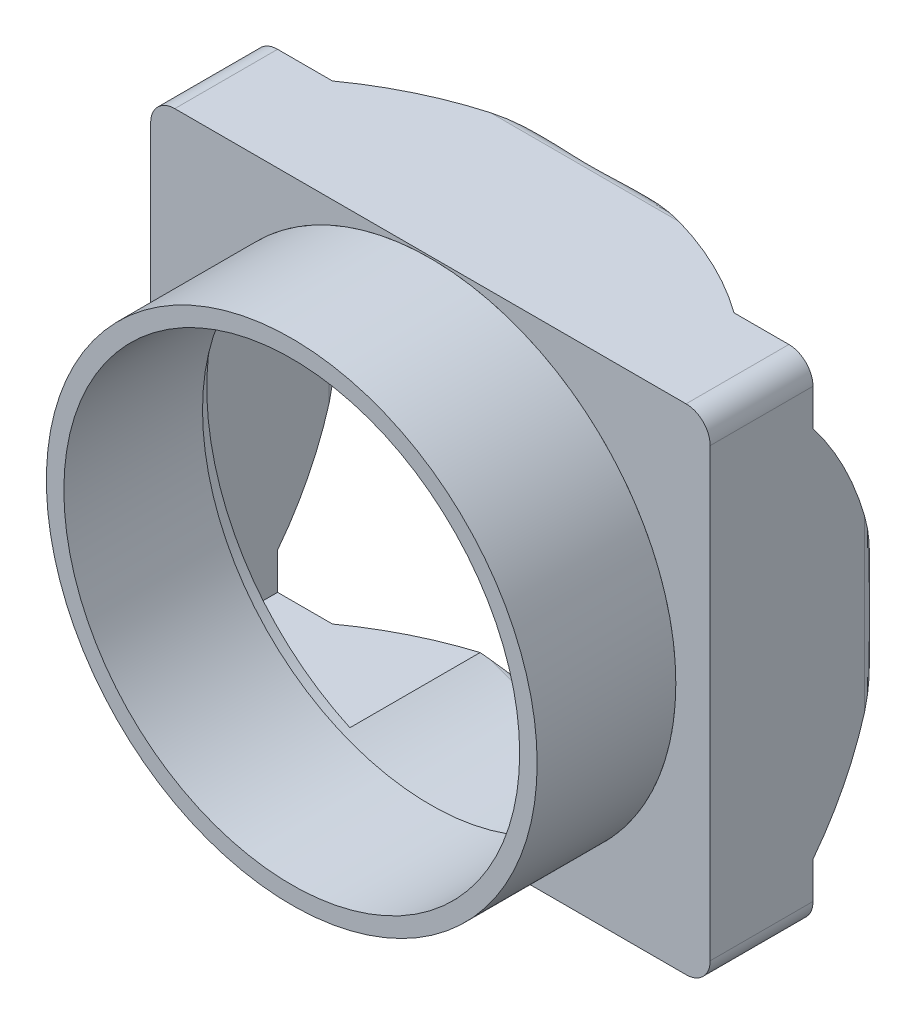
ISO-10303-21;
HEADER;
FILE_DESCRIPTION(('STEP AP214'),'2;1');
FILE_NAME('part.step','',(''),(''),'','','');
FILE_SCHEMA(('AUTOMOTIVE_DESIGN { 1 0 10303 214 1 1 1 1 }'));
ENDSEC;
DATA;
#1=APPLICATION_CONTEXT('core data for automotive mechanical design processes');
#2=APPLICATION_PROTOCOL_DEFINITION('international standard','automotive_design',2000,#1);
#3=PRODUCT_CONTEXT('',#1,'mechanical');
#4=PRODUCT('Part','Part','',(#3));
#5=PRODUCT_RELATED_PRODUCT_CATEGORY('part','',(#4));
#6=PRODUCT_DEFINITION_FORMATION('','',#4);
#7=PRODUCT_DEFINITION_CONTEXT('part definition',#1,'design');
#8=PRODUCT_DEFINITION('design','',#6,#7);
#9=PRODUCT_DEFINITION_SHAPE('','',#8);
#10=(LENGTH_UNIT() NAMED_UNIT(*) SI_UNIT(.MILLI.,.METRE.));
#11=(NAMED_UNIT(*) PLANE_ANGLE_UNIT() SI_UNIT($,.RADIAN.));
#12=(NAMED_UNIT(*) SI_UNIT($,.STERADIAN.) SOLID_ANGLE_UNIT());
#13=UNCERTAINTY_MEASURE_WITH_UNIT(LENGTH_MEASURE(1.E-05),#10,'distance_accuracy_value','');
#14=(GEOMETRIC_REPRESENTATION_CONTEXT(3) GLOBAL_UNCERTAINTY_ASSIGNED_CONTEXT((#13)) GLOBAL_UNIT_ASSIGNED_CONTEXT((#10,
#11,#12)) REPRESENTATION_CONTEXT('',''));
#15=CARTESIAN_POINT('',(0.,0.,0.));
#16=DIRECTION('',(0.,0.,1.));
#17=DIRECTION('',(1.,0.,0.));
#18=AXIS2_PLACEMENT_3D('',#15,#16,#17);
#19=CARTESIAN_POINT('',(-58.928,0.,-64.262));
#20=DIRECTION('',(-1.,0.,0.));
#21=DIRECTION('',(0.,-1.,0.));
#22=AXIS2_PLACEMENT_3D('',#19,#20,#21);
#23=PLANE('',#22);
#24=DIRECTION('',(0.,-1.,0.));
#25=VECTOR('',#24,1.);
#26=CARTESIAN_POINT('',(-58.928,-89.7189530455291,-50.8623439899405));
#27=LINE('',#26,#25);
#28=CARTESIAN_POINT('',(-58.928,-39.2762855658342,-50.8623439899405));
#29=VERTEX_POINT('',#28);
#30=CARTESIAN_POINT('',(-58.928,-46.99,-50.8623439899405));
#31=VERTEX_POINT('',#30);
#32=EDGE_CURVE('E712',#29,#31,#27,.T.);
#33=ORIENTED_EDGE('',*,*,#32,.T.);
#34=DIRECTION('',(0.,0.,1.));
#35=VECTOR('',#34,1.);
#36=CARTESIAN_POINT('',(-58.928,-46.99,-29.21));
#37=LINE('',#36,#35);
#38=CARTESIAN_POINT('',(-58.928,-46.99,-29.21));
#39=VERTEX_POINT('',#38);
#40=EDGE_CURVE('E1131',#31,#39,#37,.T.);
#41=ORIENTED_EDGE('',*,*,#40,.T.);
#42=DIRECTION('',(0.,-1.,0.));
#43=VECTOR('',#42,1.);
#44=CARTESIAN_POINT('',(-58.928,0.,-29.21));
#45=LINE('',#44,#43);
#46=CARTESIAN_POINT('',(-58.928,46.99,-29.21));
#47=VERTEX_POINT('',#46);
#48=EDGE_CURVE('E368',#47,#39,#45,.T.);
#49=ORIENTED_EDGE('',*,*,#48,.F.);
#50=DIRECTION('',(0.,0.,1.));
#51=VECTOR('',#50,1.);
#52=CARTESIAN_POINT('',(-58.928,46.99,-64.262));
#53=LINE('',#52,#51);
#54=CARTESIAN_POINT('',(-58.928,46.99,-50.8623439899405));
#55=VERTEX_POINT('',#54);
#56=EDGE_CURVE('E111',#47,#55,#53,.F.);
#57=ORIENTED_EDGE('',*,*,#56,.T.);
#58=DIRECTION('',(0.,1.,0.));
#59=VECTOR('',#58,1.);
#60=CARTESIAN_POINT('',(-58.928,-89.7189530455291,-50.8623439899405));
#61=LINE('',#60,#59);
#62=CARTESIAN_POINT('',(-58.928,39.2762855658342,-50.8623439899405));
#63=VERTEX_POINT('',#62);
#64=EDGE_CURVE('E709',#63,#55,#61,.T.);
#65=ORIENTED_EDGE('',*,*,#64,.F.);
#66=CARTESIAN_POINT('',(-58.928,0.,0.));
#67=DIRECTION('',(-1.,0.,0.));
#68=DIRECTION('',(0.,-1.,0.));
#69=AXIS2_PLACEMENT_3D('',#66,#67,#68);
#70=CIRCLE('',#69,64.262);
#71=CARTESIAN_POINT('',(-58.928,17.8885259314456,-61.722));
#72=VERTEX_POINT('',#71);
#73=EDGE_CURVE('E708',#63,#72,#70,.T.);
#74=ORIENTED_EDGE('',*,*,#73,.T.);
#75=DIRECTION('',(0.,-1.,0.));
#76=VECTOR('',#75,1.);
#77=CARTESIAN_POINT('',(-58.928,0.,-61.722));
#78=LINE('',#77,#76);
#79=CARTESIAN_POINT('',(-58.928,-17.8885259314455,-61.722));
#80=VERTEX_POINT('',#79);
#81=EDGE_CURVE('E396',#72,#80,#78,.T.);
#82=ORIENTED_EDGE('',*,*,#81,.T.);
#83=EDGE_CURVE('E706',#80,#29,#70,.T.);
#84=ORIENTED_EDGE('',*,*,#83,.T.);
#85=EDGE_LOOP('',(#33,#41,#49,#57,#65,#74,#82,#84));
#86=FACE_BOUND('',#85,.T.);
#87=ADVANCED_FACE('F89',(#86),#23,.T.);
#88=CARTESIAN_POINT('',(-122.472045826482,52.07,-64.262));
#89=DIRECTION('',(0.,1.,0.));
#90=DIRECTION('',(0.,0.,1.));
#91=AXIS2_PLACEMENT_3D('',#88,#89,#90);
#92=PLANE('',#91);
#93=DIRECTION('',(-1.,0.,0.));
#94=VECTOR('',#93,1.);
#95=CARTESIAN_POINT('',(-122.472045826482,52.07,-29.21));
#96=LINE('',#95,#94);
#97=CARTESIAN_POINT('',(53.848,52.07,-29.21));
#98=VERTEX_POINT('',#97);
#99=CARTESIAN_POINT('',(-53.848,52.07,-29.21));
#100=VERTEX_POINT('',#99);
#101=EDGE_CURVE('E371',#98,#100,#96,.T.);
#102=ORIENTED_EDGE('',*,*,#101,.F.);
#103=DIRECTION('',(0.,0.,1.));
#104=VECTOR('',#103,1.);
#105=CARTESIAN_POINT('',(53.848,52.07,-50.8623439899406));
#106=LINE('',#105,#104);
#107=CARTESIAN_POINT('',(53.848,52.07,-50.8623439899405));
#108=VERTEX_POINT('',#107);
#109=EDGE_CURVE('E1115',#98,#108,#106,.F.);
#110=ORIENTED_EDGE('',*,*,#109,.T.);
#111=DIRECTION('',(-1.,0.,0.));
#112=VECTOR('',#111,1.);
#113=CARTESIAN_POINT('',(-98.4244793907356,52.07,-50.8623439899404));
#114=LINE('',#113,#112);
#115=CARTESIAN_POINT('',(42.2915953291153,52.07,-50.8623439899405));
#116=VERTEX_POINT('',#115);
#117=EDGE_CURVE('E954',#108,#116,#114,.T.);
#118=ORIENTED_EDGE('',*,*,#117,.T.);
#119=CARTESIAN_POINT('',(0.,52.07,7.9338091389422));
#120=DIRECTION('',(0.,1.,0.));
#121=DIRECTION('',(0.,0.,1.));
#122=AXIS2_PLACEMENT_3D('',#119,#120,#121);
#123=CIRCLE('',#122,72.4262843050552);
#124=CARTESIAN_POINT('',(19.8402346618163,52.07,-61.722));
#125=VERTEX_POINT('',#124);
#126=EDGE_CURVE('E958',#116,#125,#123,.T.);
#127=ORIENTED_EDGE('',*,*,#126,.T.);
#128=DIRECTION('',(-1.,0.,0.));
#129=VECTOR('',#128,1.);
#130=CARTESIAN_POINT('',(-122.472045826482,52.07,-61.722));
#131=LINE('',#130,#129);
#132=CARTESIAN_POINT('',(-19.8402346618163,52.07,-61.722));
#133=VERTEX_POINT('',#132);
#134=EDGE_CURVE('E393',#125,#133,#131,.T.);
#135=ORIENTED_EDGE('',*,*,#134,.T.);
#136=CARTESIAN_POINT('',(-42.2915953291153,52.07,-50.8623439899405));
#137=VERTEX_POINT('',#136);
#138=EDGE_CURVE('E952',#133,#137,#123,.T.);
#139=ORIENTED_EDGE('',*,*,#138,.T.);
#140=DIRECTION('',(-1.,0.,0.));
#141=VECTOR('',#140,1.);
#142=CARTESIAN_POINT('',(-98.4244793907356,52.07,-50.8623439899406));
#143=LINE('',#142,#141);
#144=CARTESIAN_POINT('',(-53.848,52.07,-50.8623439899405));
#145=VERTEX_POINT('',#144);
#146=EDGE_CURVE('E949',#137,#145,#143,.T.);
#147=ORIENTED_EDGE('',*,*,#146,.T.);
#148=DIRECTION('',(0.,0.,1.));
#149=VECTOR('',#148,1.);
#150=CARTESIAN_POINT('',(-53.848,52.07,-64.262));
#151=LINE('',#150,#149);
#152=EDGE_CURVE('E947',#145,#100,#151,.T.);
#153=ORIENTED_EDGE('',*,*,#152,.T.);
#154=EDGE_LOOP('',(#102,#110,#118,#127,#135,#139,#147,#153));
#155=FACE_BOUND('',#154,.T.);
#156=ADVANCED_FACE('F771',(#155),#92,.T.);
#157=CARTESIAN_POINT('',(-122.472045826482,-52.07,-64.262));
#158=DIRECTION('',(0.,1.,0.));
#159=DIRECTION('',(0.,0.,1.));
#160=AXIS2_PLACEMENT_3D('',#157,#158,#159);
#161=PLANE('',#160);
#162=DIRECTION('',(-1.,0.,0.));
#163=VECTOR('',#162,1.);
#164=CARTESIAN_POINT('',(-98.4244793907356,-52.07,-50.8623439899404));
#165=LINE('',#164,#163);
#166=CARTESIAN_POINT('',(53.848,-52.07,-50.8623439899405));
#167=VERTEX_POINT('',#166);
#168=CARTESIAN_POINT('',(42.2915953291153,-52.07,-50.8623439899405));
#169=VERTEX_POINT('',#168);
#170=EDGE_CURVE('E966',#167,#169,#165,.T.);
#171=ORIENTED_EDGE('',*,*,#170,.F.);
#172=DIRECTION('',(0.,0.,1.));
#173=VECTOR('',#172,1.);
#174=CARTESIAN_POINT('',(53.848,-52.07,-64.262));
#175=LINE('',#174,#173);
#176=CARTESIAN_POINT('',(53.848,-52.07,-29.21));
#177=VERTEX_POINT('',#176);
#178=EDGE_CURVE('E1121',#167,#177,#175,.T.);
#179=ORIENTED_EDGE('',*,*,#178,.T.);
#180=DIRECTION('',(-1.,0.,0.));
#181=VECTOR('',#180,1.);
#182=CARTESIAN_POINT('',(-122.472045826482,-52.07,-29.21));
#183=LINE('',#182,#181);
#184=CARTESIAN_POINT('',(-53.848,-52.07,-29.21));
#185=VERTEX_POINT('',#184);
#186=EDGE_CURVE('E377',#177,#185,#183,.T.);
#187=ORIENTED_EDGE('',*,*,#186,.T.);
#188=DIRECTION('',(0.,0.,1.));
#189=VECTOR('',#188,1.);
#190=CARTESIAN_POINT('',(-53.848,-52.07,-50.8623439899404));
#191=LINE('',#190,#189);
#192=CARTESIAN_POINT('',(-53.848,-52.07,-50.8623439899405));
#193=VERTEX_POINT('',#192);
#194=EDGE_CURVE('E1119',#185,#193,#191,.F.);
#195=ORIENTED_EDGE('',*,*,#194,.T.);
#196=DIRECTION('',(-1.,0.,0.));
#197=VECTOR('',#196,1.);
#198=CARTESIAN_POINT('',(-98.4244793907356,-52.07,-50.8623439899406));
#199=LINE('',#198,#197);
#200=CARTESIAN_POINT('',(-42.2915953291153,-52.07,-50.8623439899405));
#201=VERTEX_POINT('',#200);
#202=EDGE_CURVE('E963',#201,#193,#199,.T.);
#203=ORIENTED_EDGE('',*,*,#202,.F.);
#204=CARTESIAN_POINT('',(0.,-52.07,7.9338091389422));
#205=DIRECTION('',(0.,1.,0.));
#206=DIRECTION('',(0.,0.,1.));
#207=AXIS2_PLACEMENT_3D('',#204,#205,#206);
#208=CIRCLE('',#207,72.4262843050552);
#209=CARTESIAN_POINT('',(-19.8402346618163,-52.07,-61.722));
#210=VERTEX_POINT('',#209);
#211=EDGE_CURVE('E953',#210,#201,#208,.T.);
#212=ORIENTED_EDGE('',*,*,#211,.F.);
#213=DIRECTION('',(-1.,0.,0.));
#214=VECTOR('',#213,1.);
#215=CARTESIAN_POINT('',(58.928,-52.07,-61.722));
#216=LINE('',#215,#214);
#217=CARTESIAN_POINT('',(19.8402346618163,-52.07,-61.722));
#218=VERTEX_POINT('',#217);
#219=EDGE_CURVE('E387',#210,#218,#216,.F.);
#220=ORIENTED_EDGE('',*,*,#219,.T.);
#221=EDGE_CURVE('E956',#169,#218,#208,.T.);
#222=ORIENTED_EDGE('',*,*,#221,.F.);
#223=EDGE_LOOP('',(#171,#179,#187,#195,#203,#212,#220,#222));
#224=FACE_BOUND('',#223,.T.);
#225=ADVANCED_FACE('F775',(#224),#161,.F.);
#226=CARTESIAN_POINT('',(58.928,0.,-64.262));
#227=DIRECTION('',(-1.,0.,0.));
#228=DIRECTION('',(0.,-1.,0.));
#229=AXIS2_PLACEMENT_3D('',#226,#227,#228);
#230=PLANE('',#229);
#231=DIRECTION('',(0.,1.,0.));
#232=VECTOR('',#231,1.);
#233=CARTESIAN_POINT('',(58.928,-89.7189530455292,-50.8623439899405));
#234=LINE('',#233,#232);
#235=CARTESIAN_POINT('',(58.9280000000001,39.2762855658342,-50.8623439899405));
#236=VERTEX_POINT('',#235);
#237=CARTESIAN_POINT('',(58.9280000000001,46.99,-50.8623439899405));
#238=VERTEX_POINT('',#237);
#239=EDGE_CURVE('E729',#236,#238,#234,.T.);
#240=ORIENTED_EDGE('',*,*,#239,.T.);
#241=DIRECTION('',(0.,0.,1.));
#242=VECTOR('',#241,1.);
#243=CARTESIAN_POINT('',(58.928,46.99,-29.21));
#244=LINE('',#243,#242);
#245=CARTESIAN_POINT('',(58.928,46.99,-29.21));
#246=VERTEX_POINT('',#245);
#247=EDGE_CURVE('E1118',#238,#246,#244,.T.);
#248=ORIENTED_EDGE('',*,*,#247,.T.);
#249=DIRECTION('',(0.,-1.,0.));
#250=VECTOR('',#249,1.);
#251=CARTESIAN_POINT('',(58.928,0.,-29.21));
#252=LINE('',#251,#250);
#253=CARTESIAN_POINT('',(58.928,-46.99,-29.21));
#254=VERTEX_POINT('',#253);
#255=EDGE_CURVE('E374',#246,#254,#252,.T.);
#256=ORIENTED_EDGE('',*,*,#255,.T.);
#257=DIRECTION('',(0.,0.,1.));
#258=VECTOR('',#257,1.);
#259=CARTESIAN_POINT('',(58.928,-46.99,-64.262));
#260=LINE('',#259,#258);
#261=CARTESIAN_POINT('',(58.928,-46.99,-50.8623439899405));
#262=VERTEX_POINT('',#261);
#263=EDGE_CURVE('E339',#254,#262,#260,.F.);
#264=ORIENTED_EDGE('',*,*,#263,.T.);
#265=DIRECTION('',(0.,-1.,0.));
#266=VECTOR('',#265,1.);
#267=CARTESIAN_POINT('',(58.928,-89.7189530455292,-50.8623439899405));
#268=LINE('',#267,#266);
#269=CARTESIAN_POINT('',(58.928,-39.2762855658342,-50.8623439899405));
#270=VERTEX_POINT('',#269);
#271=EDGE_CURVE('E716',#270,#262,#268,.T.);
#272=ORIENTED_EDGE('',*,*,#271,.F.);
#273=CARTESIAN_POINT('',(58.928,0.,0.));
#274=DIRECTION('',(-1.,0.,0.));
#275=DIRECTION('',(0.,-1.,0.));
#276=AXIS2_PLACEMENT_3D('',#273,#274,#275);
#277=CIRCLE('',#276,64.262);
#278=CARTESIAN_POINT('',(58.928,-17.8885259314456,-61.722));
#279=VERTEX_POINT('',#278);
#280=EDGE_CURVE('E720',#279,#270,#277,.T.);
#281=ORIENTED_EDGE('',*,*,#280,.F.);
#282=DIRECTION('',(0.,-1.,0.));
#283=VECTOR('',#282,1.);
#284=CARTESIAN_POINT('',(58.928,52.07,-61.722));
#285=LINE('',#284,#283);
#286=CARTESIAN_POINT('',(58.928,17.8885259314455,-61.722));
#287=VERTEX_POINT('',#286);
#288=EDGE_CURVE('E390',#279,#287,#285,.F.);
#289=ORIENTED_EDGE('',*,*,#288,.T.);
#290=EDGE_CURVE('E733',#236,#287,#277,.T.);
#291=ORIENTED_EDGE('',*,*,#290,.F.);
#292=EDGE_LOOP('',(#240,#248,#256,#264,#272,#281,#289,#291));
#293=FACE_BOUND('',#292,.T.);
#294=ADVANCED_FACE('F763',(#293),#230,.F.);
#295=CARTESIAN_POINT('',(0.,0.,-64.262));
#296=DIRECTION('',(0.,0.,1.));
#297=DIRECTION('',(1.,0.,0.));
#298=AXIS2_PLACEMENT_3D('',#295,#296,#297);
#299=CYLINDRICAL_SURFACE('',#298,51.689);
#300=CARTESIAN_POINT('',(0.,0.,-29.21));
#301=DIRECTION('',(0.,0.,-1.));
#302=DIRECTION('',(-1.,0.,0.));
#303=AXIS2_PLACEMENT_3D('',#300,#301,#302);
#304=CIRCLE('',#303,51.689);
#305=CARTESIAN_POINT('',(-51.689,0.,-29.21));
#306=VERTEX_POINT('',#305);
#307=EDGE_CURVE('E380',#306,#306,#304,.F.);
#308=ORIENTED_EDGE('',*,*,#307,.T.);
#309=EDGE_LOOP('',(#308));
#310=FACE_BOUND('',#309,.T.);
#311=CARTESIAN_POINT('',(19.8402346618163,-47.729632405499,-61.722));
#312=CARTESIAN_POINT('',(20.5474737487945,-47.4356561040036,-61.5205717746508));
#313=CARTESIAN_POINT('',(21.2458871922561,-47.1268965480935,-61.309980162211));
#314=CARTESIAN_POINT('',(22.6239724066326,-46.4810427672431,-60.8720377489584));
#315=CARTESIAN_POINT('',(23.3036471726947,-46.1439531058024,-60.6446896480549));
#316=CARTESIAN_POINT('',(24.6428020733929,-45.4428848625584,-60.1749432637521));
#317=CARTESIAN_POINT('',(25.3022994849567,-45.0789302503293,-59.9325584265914));
#318=CARTESIAN_POINT('',(26.6009235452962,-44.3250200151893,-59.4341461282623));
#319=CARTESIAN_POINT('',(27.2400494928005,-43.9350634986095,-59.1781181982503));
#320=CARTESIAN_POINT('',(29.0988181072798,-42.7451101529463,-58.4032134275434));
#321=CARTESIAN_POINT('',(30.2889319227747,-41.9097102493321,-57.8671813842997));
#322=CARTESIAN_POINT('',(32.5848134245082,-40.1506518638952,-56.76101934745));
#323=CARTESIAN_POINT('',(33.6905784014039,-39.2269905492,-56.1908882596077));
#324=CARTESIAN_POINT('',(35.4548246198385,-37.6245604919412,-55.2260095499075));
#325=CARTESIAN_POINT('',(36.1378473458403,-36.9689364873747,-54.8373354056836));
#326=CARTESIAN_POINT('',(37.4651361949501,-35.6231546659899,-54.054284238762));
#327=CARTESIAN_POINT('',(38.1094128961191,-34.9330063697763,-53.659908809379));
#328=CARTESIAN_POINT('',(39.367837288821,-33.5088433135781,-52.8634139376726));
#329=CARTESIAN_POINT('',(39.9814084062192,-32.7743355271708,-52.4612654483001));
#330=CARTESIAN_POINT('',(41.1675214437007,-31.2714455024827,-51.6591065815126));
#331=CARTESIAN_POINT('',(41.7400531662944,-30.5030549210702,-51.2590967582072));
#332=CARTESIAN_POINT('',(42.2915953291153,-29.7182382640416,-50.8623439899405));
#333=B_SPLINE_CURVE_WITH_KNOTS('',3,(#311,#312,#313,#314,#315,#316,#317,#318,#319,#320,#321,
#322,#323,#324,#325,#326,#327,#328,#329,#330,#331,#332),.UNSPECIFIED.,.F.,.F.,(4,2,2,2,2,2,2,2,
2,2,4),(0.,2.37551074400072,4.75063956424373,7.12367427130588,9.49679058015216,14.1400207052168,
18.7833999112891,21.852488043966,24.9207344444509,28.0337368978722,31.1475102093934),.UNSPECIFIED.);
#334=CARTESIAN_POINT('',(19.8402346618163,-47.729632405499,-61.722));
#335=VERTEX_POINT('',#334);
#336=CARTESIAN_POINT('',(21.5335231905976,-46.9900000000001,-61.2172865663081));
#337=VERTEX_POINT('',#336);
#338=EDGE_CURVE('E494',#335,#337,#333,.T.);
#339=ORIENTED_EDGE('',*,*,#338,.F.);
#340=CARTESIAN_POINT('',(0.,0.,-61.722));
#341=DIRECTION('',(0.,0.,-1.));
#342=DIRECTION('',(-1.,0.,0.));
#343=AXIS2_PLACEMENT_3D('',#340,#341,#342);
#344=CIRCLE('',#343,51.689);
#345=CARTESIAN_POINT('',(-19.8402346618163,-47.729632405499,-61.722));
#346=VERTEX_POINT('',#345);
#347=EDGE_CURVE('E405',#335,#346,#344,.T.);
#348=ORIENTED_EDGE('',*,*,#347,.T.);
#349=CARTESIAN_POINT('',(-42.2915953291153,-29.7182382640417,-50.8623439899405));
#350=CARTESIAN_POINT('',(-41.8559903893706,-30.3381109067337,-51.1756839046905));
#351=CARTESIAN_POINT('',(-41.4072833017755,-30.9477168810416,-51.4910773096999));
#352=CARTESIAN_POINT('',(-40.4840535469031,-32.1460215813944,-52.1238369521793));
#353=CARTESIAN_POINT('',(-40.0095303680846,-32.7347198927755,-52.4412032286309));
#354=CARTESIAN_POINT('',(-39.0346653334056,-33.8912961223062,-53.0760282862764));
#355=CARTESIAN_POINT('',(-38.534302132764,-34.4591561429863,-53.3934869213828));
#356=CARTESIAN_POINT('',(-37.5085207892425,-35.5729790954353,-54.0261841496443));
#357=CARTESIAN_POINT('',(-36.9831029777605,-36.1189423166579,-54.3414227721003));
#358=CARTESIAN_POINT('',(-35.3949398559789,-37.6980764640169,-55.2662014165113));
#359=CARTESIAN_POINT('',(-34.2972002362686,-38.6998392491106,-55.8699810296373));
#360=CARTESIAN_POINT('',(-32.0104464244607,-40.6116156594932,-57.0473479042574));
#361=CARTESIAN_POINT('',(-30.8214812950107,-41.5216780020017,-57.6209511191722));
#362=CARTESIAN_POINT('',(-28.8436045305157,-42.902503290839,-58.5062380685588));
#363=CARTESIAN_POINT('',(-28.0825617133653,-43.4045989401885,-58.8317481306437));
#364=CARTESIAN_POINT('',(-26.5294292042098,-44.3709177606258,-59.4639560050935));
#365=CARTESIAN_POINT('',(-25.7373465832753,-44.8351494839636,-59.7706580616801));
#366=CARTESIAN_POINT('',(-24.1117498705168,-45.7301785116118,-60.3666292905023));
#367=CARTESIAN_POINT('',(-23.2778054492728,-46.1604031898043,-60.655586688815));
#368=CARTESIAN_POINT('',(-21.5805332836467,-46.9778828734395,-61.2084038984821));
#369=CARTESIAN_POINT('',(-20.7171918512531,-47.3651174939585,-61.4722517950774));
#370=CARTESIAN_POINT('',(-19.8402346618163,-47.729632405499,-61.722));
#371=B_SPLINE_CURVE_WITH_KNOTS('',3,(#349,#350,#351,#352,#353,#354,#355,#356,#357,#358,#359,
#360,#361,#362,#363,#364,#365,#366,#367,#368,#369,#370),.UNSPECIFIED.,.F.,.F.,(4,2,2,2,2,2,2,2,
2,2,4),(0.,2.45939206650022,4.91883288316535,7.38033883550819,9.84181223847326,14.6484841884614,
19.4525889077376,22.3556772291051,25.258108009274,28.2020176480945,31.1473173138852),.UNSPECIFIED.);
#372=CARTESIAN_POINT('',(-21.5335231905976,-46.9900000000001,-61.2172865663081));
#373=VERTEX_POINT('',#372);
#374=EDGE_CURVE('E449',#373,#346,#371,.T.);
#375=ORIENTED_EDGE('',*,*,#374,.F.);
#376=DIRECTION('',(0.,0.,1.));
#377=VECTOR('',#376,1.);
#378=CARTESIAN_POINT('',(-21.5335231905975,-46.99,-64.262));
#379=LINE('',#378,#377);
#380=CARTESIAN_POINT('',(-21.5335231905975,-46.99,-33.782));
#381=VERTEX_POINT('',#380);
#382=EDGE_CURVE('E350',#373,#381,#379,.T.);
#383=ORIENTED_EDGE('',*,*,#382,.T.);
#384=CARTESIAN_POINT('',(0.,0.,-33.782));
#385=DIRECTION('',(0.,0.,-1.));
#386=DIRECTION('',(-1.,0.,0.));
#387=AXIS2_PLACEMENT_3D('',#384,#385,#386);
#388=CIRCLE('',#387,51.689);
#389=CARTESIAN_POINT('',(-21.5335231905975,46.99,-33.782));
#390=VERTEX_POINT('',#389);
#391=EDGE_CURVE('E383',#390,#381,#388,.F.);
#392=ORIENTED_EDGE('',*,*,#391,.F.);
#393=DIRECTION('',(0.,0.,1.));
#394=VECTOR('',#393,1.);
#395=CARTESIAN_POINT('',(-21.5335231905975,46.99,-64.262));
#396=LINE('',#395,#394);
#397=CARTESIAN_POINT('',(-21.5335231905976,46.9900000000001,-61.2172865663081));
#398=VERTEX_POINT('',#397);
#399=EDGE_CURVE('E365',#390,#398,#396,.F.);
#400=ORIENTED_EDGE('',*,*,#399,.T.);
#401=CARTESIAN_POINT('',(-19.8402346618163,47.729632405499,-61.722));
#402=CARTESIAN_POINT('',(-20.5474737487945,47.4356561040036,-61.5205717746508));
#403=CARTESIAN_POINT('',(-21.2458871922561,47.1268965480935,-61.309980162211));
#404=CARTESIAN_POINT('',(-22.6239724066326,46.4810427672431,-60.8720377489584));
#405=CARTESIAN_POINT('',(-23.3036471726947,46.1439531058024,-60.6446896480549));
#406=CARTESIAN_POINT('',(-24.6428020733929,45.4428848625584,-60.1749432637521));
#407=CARTESIAN_POINT('',(-25.3022994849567,45.0789302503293,-59.9325584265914));
#408=CARTESIAN_POINT('',(-26.6009235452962,44.3250200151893,-59.4341461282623));
#409=CARTESIAN_POINT('',(-27.2400494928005,43.9350634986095,-59.1781181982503));
#410=CARTESIAN_POINT('',(-29.0988181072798,42.7451101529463,-58.4032134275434));
#411=CARTESIAN_POINT('',(-30.2889319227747,41.9097102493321,-57.8671813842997));
#412=CARTESIAN_POINT('',(-32.5848134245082,40.1506518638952,-56.76101934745));
#413=CARTESIAN_POINT('',(-33.6905784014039,39.2269905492,-56.1908882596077));
#414=CARTESIAN_POINT('',(-35.4548246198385,37.6245604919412,-55.2260095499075));
#415=CARTESIAN_POINT('',(-36.1378473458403,36.9689364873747,-54.8373354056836));
#416=CARTESIAN_POINT('',(-37.4651361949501,35.6231546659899,-54.054284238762));
#417=CARTESIAN_POINT('',(-38.1094128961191,34.9330063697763,-53.659908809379));
#418=CARTESIAN_POINT('',(-39.3678372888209,33.5088433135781,-52.8634139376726));
#419=CARTESIAN_POINT('',(-39.9814084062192,32.7743355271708,-52.4612654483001));
#420=CARTESIAN_POINT('',(-41.1675214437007,31.2714455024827,-51.6591065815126));
#421=CARTESIAN_POINT('',(-41.7400531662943,30.5030549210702,-51.2590967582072));
#422=CARTESIAN_POINT('',(-42.2915953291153,29.7182382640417,-50.8623439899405));
#423=B_SPLINE_CURVE_WITH_KNOTS('',3,(#401,#402,#403,#404,#405,#406,#407,#408,#409,#410,#411,
#412,#413,#414,#415,#416,#417,#418,#419,#420,#421,#422),.UNSPECIFIED.,.F.,.F.,(4,2,2,2,2,2,2,2,
2,2,4),(0.,2.37551074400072,4.75063956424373,7.12367427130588,9.49679058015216,14.1400207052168,
18.7833999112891,21.852488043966,24.9207344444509,28.0337368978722,31.1475102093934),.UNSPECIFIED.);
#424=CARTESIAN_POINT('',(-19.8402346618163,47.729632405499,-61.722));
#425=VERTEX_POINT('',#424);
#426=EDGE_CURVE('E530',#425,#398,#423,.T.);
#427=ORIENTED_EDGE('',*,*,#426,.F.);
#428=CARTESIAN_POINT('',(0.,0.,-61.722));
#429=DIRECTION('',(0.,0.,-1.));
#430=DIRECTION('',(-1.,0.,0.));
#431=AXIS2_PLACEMENT_3D('',#428,#429,#430);
#432=CIRCLE('',#431,51.689);
#433=CARTESIAN_POINT('',(19.8402346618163,47.729632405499,-61.722));
#434=VERTEX_POINT('',#433);
#435=EDGE_CURVE('E402',#425,#434,#432,.T.);
#436=ORIENTED_EDGE('',*,*,#435,.T.);
#437=CARTESIAN_POINT('',(42.2915953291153,29.7182382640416,-50.8623439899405));
#438=CARTESIAN_POINT('',(41.8559903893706,30.3381109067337,-51.1756839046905));
#439=CARTESIAN_POINT('',(41.4072833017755,30.9477168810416,-51.4910773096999));
#440=CARTESIAN_POINT('',(40.4840535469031,32.1460215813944,-52.1238369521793));
#441=CARTESIAN_POINT('',(40.0095303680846,32.7347198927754,-52.4412032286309));
#442=CARTESIAN_POINT('',(39.0346653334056,33.8912961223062,-53.0760282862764));
#443=CARTESIAN_POINT('',(38.534302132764,34.4591561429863,-53.3934869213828));
#444=CARTESIAN_POINT('',(37.5085207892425,35.5729790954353,-54.0261841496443));
#445=CARTESIAN_POINT('',(36.9831029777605,36.1189423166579,-54.3414227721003));
#446=CARTESIAN_POINT('',(35.394939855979,37.6980764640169,-55.2662014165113));
#447=CARTESIAN_POINT('',(34.2972002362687,38.6998392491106,-55.8699810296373));
#448=CARTESIAN_POINT('',(32.0104464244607,40.6116156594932,-57.0473479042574));
#449=CARTESIAN_POINT('',(30.8214812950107,41.5216780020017,-57.6209511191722));
#450=CARTESIAN_POINT('',(28.8436045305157,42.902503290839,-58.5062380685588));
#451=CARTESIAN_POINT('',(28.0825617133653,43.4045989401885,-58.8317481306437));
#452=CARTESIAN_POINT('',(26.5294292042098,44.3709177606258,-59.4639560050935));
#453=CARTESIAN_POINT('',(25.7373465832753,44.8351494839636,-59.7706580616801));
#454=CARTESIAN_POINT('',(24.1117498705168,45.7301785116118,-60.3666292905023));
#455=CARTESIAN_POINT('',(23.2778054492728,46.1604031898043,-60.655586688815));
#456=CARTESIAN_POINT('',(21.5805332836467,46.9778828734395,-61.2084038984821));
#457=CARTESIAN_POINT('',(20.7171918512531,47.3651174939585,-61.4722517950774));
#458=CARTESIAN_POINT('',(19.8402346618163,47.729632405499,-61.722));
#459=B_SPLINE_CURVE_WITH_KNOTS('',3,(#437,#438,#439,#440,#441,#442,#443,#444,#445,#446,#447,
#448,#449,#450,#451,#452,#453,#454,#455,#456,#457,#458),.UNSPECIFIED.,.F.,.F.,(4,2,2,2,2,2,2,2,
2,2,4),(0.,2.45939206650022,4.91883288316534,7.38033883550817,9.84181223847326,14.6484841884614,
19.4525889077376,22.3556772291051,25.258108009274,28.2020176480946,31.1473173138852),.UNSPECIFIED.);
#460=CARTESIAN_POINT('',(21.5335231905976,46.9900000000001,-61.2172865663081));
#461=VERTEX_POINT('',#460);
#462=EDGE_CURVE('E514',#461,#434,#459,.T.);
#463=ORIENTED_EDGE('',*,*,#462,.F.);
#464=DIRECTION('',(0.,0.,1.));
#465=VECTOR('',#464,1.);
#466=CARTESIAN_POINT('',(21.5335231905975,46.99,-64.262));
#467=LINE('',#466,#465);
#468=CARTESIAN_POINT('',(21.5335231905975,46.99,-33.782));
#469=VERTEX_POINT('',#468);
#470=EDGE_CURVE('E363',#461,#469,#467,.T.);
#471=ORIENTED_EDGE('',*,*,#470,.T.);
#472=CARTESIAN_POINT('',(21.5335231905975,-46.99,-33.782));
#473=VERTEX_POINT('',#472);
#474=EDGE_CURVE('E386',#473,#469,#388,.F.);
#475=ORIENTED_EDGE('',*,*,#474,.F.);
#476=DIRECTION('',(0.,0.,1.));
#477=VECTOR('',#476,1.);
#478=CARTESIAN_POINT('',(21.5335231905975,-46.99,-64.262));
#479=LINE('',#478,#477);
#480=EDGE_CURVE('E360',#473,#337,#479,.F.);
#481=ORIENTED_EDGE('',*,*,#480,.T.);
#482=EDGE_LOOP('',(#339,#348,#375,#383,#392,#400,#427,#436,#463,#471,#475,#481));
#483=FACE_BOUND('',#482,.T.);
#484=ADVANCED_FACE('F662',(#310,#483),#299,.F.);
#485=CARTESIAN_POINT('',(53.848,-46.99,-33.782));
#486=DIRECTION('',(0.,-1.,0.));
#487=DIRECTION('',(0.,0.,-1.));
#488=AXIS2_PLACEMENT_3D('',#485,#486,#487);
#489=PLANE('',#488);
#490=CARTESIAN_POINT('',(0.,-46.99,7.9338091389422));
#491=DIRECTION('',(0.,-1.,0.));
#492=DIRECTION('',(0.,0.,-1.));
#493=AXIS2_PLACEMENT_3D('',#490,#491,#492);
#494=CIRCLE('',#493,72.4262843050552);
#495=CARTESIAN_POINT('',(-42.2915953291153,-46.99,-50.8623439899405));
#496=VERTEX_POINT('',#495);
#497=EDGE_CURVE('E679',#496,#373,#494,.T.);
#498=ORIENTED_EDGE('',*,*,#497,.F.);
#499=DIRECTION('',(1.,0.,0.));
#500=VECTOR('',#499,1.);
#501=CARTESIAN_POINT('',(53.848,-46.99,-50.8623439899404));
#502=LINE('',#501,#500);
#503=CARTESIAN_POINT('',(-53.848,-46.99,-50.8623439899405));
#504=VERTEX_POINT('',#503);
#505=EDGE_CURVE('E714',#504,#496,#502,.T.);
#506=ORIENTED_EDGE('',*,*,#505,.F.);
#507=DIRECTION('',(0.,0.,-1.));
#508=VECTOR('',#507,1.);
#509=CARTESIAN_POINT('',(-53.848,-46.99,-33.782));
#510=LINE('',#509,#508);
#511=CARTESIAN_POINT('',(-53.848,-46.99,-33.782));
#512=VERTEX_POINT('',#511);
#513=EDGE_CURVE('E347',#512,#504,#510,.T.);
#514=ORIENTED_EDGE('',*,*,#513,.F.);
#515=DIRECTION('',(-1.,0.,0.));
#516=VECTOR('',#515,1.);
#517=CARTESIAN_POINT('',(53.848,-46.99,-33.782));
#518=LINE('',#517,#516);
#519=EDGE_CURVE('E631',#381,#512,#518,.T.);
#520=ORIENTED_EDGE('',*,*,#519,.F.);
#521=ORIENTED_EDGE('',*,*,#382,.F.);
#522=EDGE_LOOP('',(#498,#506,#514,#520,#521));
#523=FACE_BOUND('',#522,.T.);
#524=ADVANCED_FACE('F747',(#523),#489,.F.);
#525=CARTESIAN_POINT('',(53.848,46.99,-33.782));
#526=DIRECTION('',(0.,1.,0.));
#527=DIRECTION('',(0.,0.,1.));
#528=AXIS2_PLACEMENT_3D('',#525,#526,#527);
#529=PLANE('',#528);
#530=CARTESIAN_POINT('',(0.,46.99,7.9338091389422));
#531=DIRECTION('',(0.,1.,0.));
#532=DIRECTION('',(0.,0.,1.));
#533=AXIS2_PLACEMENT_3D('',#530,#531,#532);
#534=CIRCLE('',#533,72.4262843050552);
#535=CARTESIAN_POINT('',(-42.2915953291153,46.99,-50.8623439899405));
#536=VERTEX_POINT('',#535);
#537=EDGE_CURVE('E741',#398,#536,#534,.T.);
#538=ORIENTED_EDGE('',*,*,#537,.F.);
#539=ORIENTED_EDGE('',*,*,#399,.F.);
#540=DIRECTION('',(1.,0.,0.));
#541=VECTOR('',#540,1.);
#542=CARTESIAN_POINT('',(53.848,46.99,-33.782));
#543=LINE('',#542,#541);
#544=CARTESIAN_POINT('',(-53.848,46.99,-33.782));
#545=VERTEX_POINT('',#544);
#546=EDGE_CURVE('E345',#545,#390,#543,.T.);
#547=ORIENTED_EDGE('',*,*,#546,.F.);
#548=DIRECTION('',(0.,0.,-1.));
#549=VECTOR('',#548,1.);
#550=CARTESIAN_POINT('',(-53.848,46.99,-33.782));
#551=LINE('',#550,#549);
#552=CARTESIAN_POINT('',(-53.848,46.99,-50.8623439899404));
#553=VERTEX_POINT('',#552);
#554=EDGE_CURVE('E322',#545,#553,#551,.T.);
#555=ORIENTED_EDGE('',*,*,#554,.T.);
#556=DIRECTION('',(-1.,0.,0.));
#557=VECTOR('',#556,1.);
#558=CARTESIAN_POINT('',(53.848,46.99,-50.8623439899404));
#559=LINE('',#558,#557);
#560=EDGE_CURVE('E333',#536,#553,#559,.T.);
#561=ORIENTED_EDGE('',*,*,#560,.F.);
#562=EDGE_LOOP('',(#538,#539,#547,#555,#561));
#563=FACE_BOUND('',#562,.T.);
#564=ADVANCED_FACE('F343',(#563),#529,.F.);
#565=CARTESIAN_POINT('',(0.,46.99,7.9338091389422));
#566=DIRECTION('',(0.,1.,0.));
#567=DIRECTION('',(0.,0.,1.));
#568=AXIS2_PLACEMENT_3D('',#565,#566,#567);
#569=CIRCLE('',#568,72.4262843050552);
#570=CARTESIAN_POINT('',(42.2915953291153,46.99,-50.8623439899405));
#571=VERTEX_POINT('',#570);
#572=EDGE_CURVE('E664',#571,#461,#569,.T.);
#573=ORIENTED_EDGE('',*,*,#572,.F.);
#574=DIRECTION('',(-1.,0.,0.));
#575=VECTOR('',#574,1.);
#576=CARTESIAN_POINT('',(53.848,46.99,-50.8623439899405));
#577=LINE('',#576,#575);
#578=CARTESIAN_POINT('',(53.848,46.9899999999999,-50.8623439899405));
#579=VERTEX_POINT('',#578);
#580=EDGE_CURVE('E649',#579,#571,#577,.T.);
#581=ORIENTED_EDGE('',*,*,#580,.F.);
#582=DIRECTION('',(0.,0.,-1.));
#583=VECTOR('',#582,1.);
#584=CARTESIAN_POINT('',(53.848,46.99,-33.782));
#585=LINE('',#584,#583);
#586=CARTESIAN_POINT('',(53.848,46.99,-33.782));
#587=VERTEX_POINT('',#586);
#588=EDGE_CURVE('E346',#587,#579,#585,.T.);
#589=ORIENTED_EDGE('',*,*,#588,.F.);
#590=EDGE_CURVE('E636',#469,#587,#543,.T.);
#591=ORIENTED_EDGE('',*,*,#590,.F.);
#592=ORIENTED_EDGE('',*,*,#470,.F.);
#593=EDGE_LOOP('',(#573,#581,#589,#591,#592));
#594=FACE_BOUND('',#593,.T.);
#595=ADVANCED_FACE('F648',(#594),#529,.F.);
#596=CARTESIAN_POINT('',(0.,-46.99,7.9338091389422));
#597=DIRECTION('',(0.,-1.,0.));
#598=DIRECTION('',(0.,0.,-1.));
#599=AXIS2_PLACEMENT_3D('',#596,#597,#598);
#600=CIRCLE('',#599,72.4262843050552);
#601=CARTESIAN_POINT('',(42.2915953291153,-46.99,-50.8623439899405));
#602=VERTEX_POINT('',#601);
#603=EDGE_CURVE('E672',#337,#602,#600,.T.);
#604=ORIENTED_EDGE('',*,*,#603,.F.);
#605=ORIENTED_EDGE('',*,*,#480,.F.);
#606=CARTESIAN_POINT('',(53.848,-46.99,-33.782));
#607=VERTEX_POINT('',#606);
#608=EDGE_CURVE('E632',#607,#473,#518,.T.);
#609=ORIENTED_EDGE('',*,*,#608,.F.);
#610=DIRECTION('',(0.,0.,-1.));
#611=VECTOR('',#610,1.);
#612=CARTESIAN_POINT('',(53.848,-46.99,-33.782));
#613=LINE('',#612,#611);
#614=CARTESIAN_POINT('',(53.848,-46.99,-50.8623439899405));
#615=VERTEX_POINT('',#614);
#616=EDGE_CURVE('E353',#607,#615,#613,.T.);
#617=ORIENTED_EDGE('',*,*,#616,.T.);
#618=DIRECTION('',(1.,0.,0.));
#619=VECTOR('',#618,1.);
#620=CARTESIAN_POINT('',(53.848,-46.99,-50.8623439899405));
#621=LINE('',#620,#619);
#622=EDGE_CURVE('E340',#602,#615,#621,.T.);
#623=ORIENTED_EDGE('',*,*,#622,.F.);
#624=EDGE_LOOP('',(#604,#605,#609,#617,#623));
#625=FACE_BOUND('',#624,.T.);
#626=ADVANCED_FACE('F538',(#625),#489,.F.);
#627=CARTESIAN_POINT('',(0.,0.,-61.722));
#628=DIRECTION('',(0.,0.,-1.));
#629=DIRECTION('',(-1.,0.,0.));
#630=AXIS2_PLACEMENT_3D('',#627,#628,#629);
#631=TOROIDAL_SURFACE('',#630,54.229,2.54);
#632=CARTESIAN_POINT('',(22.0808410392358,49.53,-64.262));
#633=CARTESIAN_POINT('',(22.0756909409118,49.5310959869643,-64.2619999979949));
#634=CARTESIAN_POINT('',(22.0705407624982,49.532191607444,-64.2619992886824));
#635=CARTESIAN_POINT('',(21.6510316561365,49.6214044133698,-64.2618840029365));
#636=CARTESIAN_POINT('',(21.2361559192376,49.7071492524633,-64.2572000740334));
#637=CARTESIAN_POINT('',(20.4055747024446,49.8738186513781,-64.2400159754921));
#638=CARTESIAN_POINT('',(19.9898691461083,49.9547427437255,-64.2275150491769));
#639=CARTESIAN_POINT('',(19.157442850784,50.1117774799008,-64.1957737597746));
#640=CARTESIAN_POINT('',(18.7407215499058,50.1878839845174,-64.1765276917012));
#641=CARTESIAN_POINT('',(17.9067856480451,50.3351562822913,-64.1322347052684));
#642=CARTESIAN_POINT('',(17.489571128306,50.406322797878,-64.1071886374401));
#643=CARTESIAN_POINT('',(16.2320399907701,50.6132316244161,-64.0242602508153));
#644=CARTESIAN_POINT('',(15.3909650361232,50.7414147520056,-63.9588040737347));
#645=CARTESIAN_POINT('',(13.707184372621,50.9775157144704,-63.8137625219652));
#646=CARTESIAN_POINT('',(12.8644785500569,51.0854320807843,-63.7341761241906));
#647=CARTESIAN_POINT('',(11.1767014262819,51.2809698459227,-63.5665201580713));
#648=CARTESIAN_POINT('',(10.3316286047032,51.3685709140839,-63.4784422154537));
#649=CARTESIAN_POINT('',(9.06268191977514,51.4845788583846,-63.3451792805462));
#650=CARTESIAN_POINT('',(8.63943588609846,51.5206853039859,-63.3005629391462));
#651=CARTESIAN_POINT('',(7.79245934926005,51.5877514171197,-63.2120784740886));
#652=CARTESIAN_POINT('',(7.36872885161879,51.6187111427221,-63.1682103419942));
#653=CARTESIAN_POINT('',(6.52123793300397,51.675434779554,-63.082639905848));
#654=CARTESIAN_POINT('',(6.09747821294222,51.7012051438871,-63.0409349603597));
#655=CARTESIAN_POINT('',(5.2493058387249,51.7475819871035,-62.9613745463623));
#656=CARTESIAN_POINT('',(4.82489317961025,51.7681884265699,-62.9235191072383));
#657=CARTESIAN_POINT('',(3.97551670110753,51.8042079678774,-62.8538644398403));
#658=CARTESIAN_POINT('',(3.55055318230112,51.8196232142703,-62.8220627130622));
#659=CARTESIAN_POINT('',(2.6999037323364,51.8452446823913,-62.767069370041));
#660=CARTESIAN_POINT('',(2.27421781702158,51.8554510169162,-62.7438775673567));
#661=CARTESIAN_POINT('',(1.42289886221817,51.8706152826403,-62.7086605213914));
#662=CARTESIAN_POINT('',(0.997266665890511,51.8755809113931,-62.6966189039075));
#663=CARTESIAN_POINT('',(0.145806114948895,51.8802708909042,-62.6852603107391));
#664=CARTESIAN_POINT('',(-0.280022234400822,51.8799953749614,-62.6859430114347));
#665=CARTESIAN_POINT('',(-1.13152850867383,51.8742038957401,-62.6999357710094));
#666=CARTESIAN_POINT('',(-1.5572063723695,51.8686866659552,-62.7132488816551));
#667=CARTESIAN_POINT('',(-2.40798370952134,51.852430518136,-62.7507478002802));
#668=CARTESIAN_POINT('',(-2.83308315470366,51.8416913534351,-62.7749341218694));
#669=CARTESIAN_POINT('',(-3.65281179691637,51.8159537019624,-62.8296365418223));
#670=CARTESIAN_POINT('',(-4.04749075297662,51.8013060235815,-62.8595909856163));
#671=CARTESIAN_POINT('',(-4.83621879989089,51.7675410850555,-62.9246435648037));
#672=CARTESIAN_POINT('',(-5.23026790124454,51.7484239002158,-62.9597416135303));
#673=CARTESIAN_POINT('',(-6.01780602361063,51.7057370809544,-63.0333267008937));
#674=CARTESIAN_POINT('',(-6.41129504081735,51.6821674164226,-63.0718137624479));
#675=CARTESIAN_POINT('',(-7.19778772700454,51.6305890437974,-63.150758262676));
#676=CARTESIAN_POINT('',(-7.59079138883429,51.6025802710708,-63.1912157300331));
#677=CARTESIAN_POINT('',(-8.37716384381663,51.5420740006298,-63.2730490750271));
#678=CARTESIAN_POINT('',(-8.7705317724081,51.5095675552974,-63.3144266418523));
#679=CARTESIAN_POINT('',(-9.55688505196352,51.4401190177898,-63.3971012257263));
#680=CARTESIAN_POINT('',(-9.94987040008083,51.4031768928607,-63.438398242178));
#681=CARTESIAN_POINT('',(-11.1282531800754,51.285715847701,-63.5609802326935));
#682=CARTESIAN_POINT('',(-11.9131378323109,51.1985575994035,-63.6409626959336));
#683=CARTESIAN_POINT('',(-13.481664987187,51.0066109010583,-63.792312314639));
#684=CARTESIAN_POINT('',(-14.2653073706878,50.9018208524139,-63.8636786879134));
#685=CARTESIAN_POINT('',(-15.8312297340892,50.6747141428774,-63.9931947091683));
#686=CARTESIAN_POINT('',(-16.6135095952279,50.5523960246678,-64.0513432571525));
#687=CARTESIAN_POINT('',(-18.1756098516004,50.290512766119,-64.1495082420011));
#688=CARTESIAN_POINT('',(-18.9554318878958,50.1509643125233,-64.1895420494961));
#689=CARTESIAN_POINT('',(-20.1232882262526,49.9288491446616,-64.2316163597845));
#690=CARTESIAN_POINT('',(-20.5122318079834,49.852684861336,-64.2426449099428));
#691=CARTESIAN_POINT('',(-21.2893980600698,49.6961351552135,-64.2577821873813));
#692=CARTESIAN_POINT('',(-21.6776207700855,49.6157499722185,-64.2618913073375));
#693=CARTESIAN_POINT('',(-22.0705407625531,49.5321916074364,-64.2619992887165));
#694=CARTESIAN_POINT('',(-22.0756909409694,49.5310959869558,-64.2619999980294));
#695=CARTESIAN_POINT('',(-22.0808410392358,49.53,-64.262));
#696=B_SPLINE_CURVE_WITH_KNOTS('',3,(#632,#633,#634,#635,#636,#637,#638,#639,#640,#641,#642,
#643,#644,#645,#646,#647,#648,#649,#650,#651,#652,#653,#654,#655,#656,#657,#658,#659,#660,#661,
#662,#663,#664,#665,#666,#667,#668,#669,#670,#671,#672,#673,#674,#675,#676,#677,#678,#679,#680,
#681,#682,#683,#684,#685,#686,#687,#688,#689,#690,#691,#692,#693,#694,#695),.UNSPECIFIED.,.F.,
.F.,(4,2,2,2,2,2,2,2,2,2,2,2,2,2,2,2,2,2,2,2,2,2,2,2,2,2,2,2,2,2,2,4),(0.,0.015796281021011,
1.28667018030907,2.55766711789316,3.82974165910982,5.10162977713,7.66107075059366,
10.2206971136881,12.7828740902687,14.064209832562,15.3455311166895,16.6252490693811,
17.9049767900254,19.1841751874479,20.4633458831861,21.7406351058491,23.0178918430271,
24.2954572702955,25.5730830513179,26.7612675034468,27.9494319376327,29.1376044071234,
30.325794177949,31.5163826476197,32.7069799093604,35.0879914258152,37.469218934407,
39.8506445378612,42.229781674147,43.4191719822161,44.6084947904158,44.624291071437),.UNSPECIFIED.);
#697=CARTESIAN_POINT('',(11.4062769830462,51.2525512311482,-63.5886593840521));
#698=VERTEX_POINT('',#697);
#699=CARTESIAN_POINT('',(-11.4062769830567,51.25255123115,-63.5886593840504));
#700=VERTEX_POINT('',#699);
#701=EDGE_CURVE('E419',#698,#700,#696,.T.);
#702=ORIENTED_EDGE('',*,*,#701,.F.);
#703=CARTESIAN_POINT('',(9.34160494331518,52.0702,-63.8875043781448));
#704=CARTESIAN_POINT('',(9.53730092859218,51.9929334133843,-63.8620513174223));
#705=CARTESIAN_POINT('',(9.73293771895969,51.9157829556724,-63.8357914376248));
#706=CARTESIAN_POINT('',(10.1239876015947,51.7614745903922,-63.7816736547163));
#707=CARTESIAN_POINT('',(10.319400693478,51.6843166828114,-63.7538157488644));
#708=CARTESIAN_POINT('',(10.7098950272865,51.5297548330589,-63.6965179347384));
#709=CARTESIAN_POINT('',(10.9049762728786,51.4523508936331,-63.6670780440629));
#710=CARTESIAN_POINT('',(11.2947484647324,51.2971757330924,-63.6066284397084));
#711=CARTESIAN_POINT('',(11.4894394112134,51.2194045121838,-63.5756187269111));
#712=CARTESIAN_POINT('',(12.0723827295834,50.9856065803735,-63.4803292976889));
#713=CARTESIAN_POINT('',(12.4599868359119,50.8289056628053,-63.4137186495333));
#714=CARTESIAN_POINT('',(13.2332889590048,50.513537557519,-63.2743441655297));
#715=CARTESIAN_POINT('',(13.6189869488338,50.3548703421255,-63.2015802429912));
#716=CARTESIAN_POINT('',(14.3270177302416,50.0612803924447,-63.0620484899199));
#717=CARTESIAN_POINT('',(14.6496334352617,49.9266121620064,-62.9961787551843));
#718=CARTESIAN_POINT('',(15.2935621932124,49.6563355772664,-62.8601306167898));
#719=CARTESIAN_POINT('',(15.6148752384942,49.5207272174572,-62.7899521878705));
#720=CARTESIAN_POINT('',(16.2563079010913,49.2489764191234,-62.645275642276));
#721=CARTESIAN_POINT('',(16.5764274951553,49.1128339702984,-62.5707774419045));
#722=CARTESIAN_POINT('',(17.2156307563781,48.8405607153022,-62.4174292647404));
#723=CARTESIAN_POINT('',(17.5347144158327,48.7044299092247,-62.3385792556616));
#724=CARTESIAN_POINT('',(18.1727678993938,48.4325934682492,-62.1762883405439));
#725=CARTESIAN_POINT('',(18.4917359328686,48.296889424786,-62.0928377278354));
#726=CARTESIAN_POINT('',(19.1291505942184,48.0271427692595,-61.9214067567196));
#727=CARTESIAN_POINT('',(19.4475972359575,47.893100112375,-61.833426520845));
#728=CARTESIAN_POINT('',(19.9251969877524,47.6942279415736,-61.6979405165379));
#729=CARTESIAN_POINT('',(20.0843919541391,47.6282997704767,-61.6521905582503));
#730=CARTESIAN_POINT('',(20.4028188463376,47.4973831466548,-61.5594937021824));
#731=CARTESIAN_POINT('',(20.5620507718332,47.4323946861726,-61.5125468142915));
#732=CARTESIAN_POINT('',(20.8806393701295,47.3035851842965,-61.417421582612));
#733=CARTESIAN_POINT('',(21.039996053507,47.2397642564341,-61.369243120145));
#734=CARTESIAN_POINT('',(21.3589109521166,47.1135985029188,-61.2716196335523));
#735=CARTESIAN_POINT('',(21.5184691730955,47.0512537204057,-61.2221745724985));
#736=CARTESIAN_POINT('',(21.6781696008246,46.9898,-61.1720778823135));
#737=B_SPLINE_CURVE_WITH_KNOTS('',3,(#703,#704,#705,#706,#707,#708,#709,#710,#711,#712,#713,
#714,#715,#716,#717,#718,#719,#720,#721,#722,#723,#724,#725,#726,#727,#728,#729,#730,#731,#732,
#733,#734,#735,#736),.UNSPECIFIED.,.F.,.F.,(4,2,2,2,2,2,2,2,2,2,2,2,2,2,2,2,4),(0.,
0.635792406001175,1.27158590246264,1.90737232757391,2.54315839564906,3.81316416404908,
5.08318782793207,6.15039651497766,7.21761145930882,8.28484708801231,9.35209063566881,
10.4216791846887,11.4912388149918,12.026064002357,12.5608847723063,13.0957572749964,
13.6306453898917),.UNSPECIFIED.);
#738=EDGE_CURVE('E508',#698,#434,#737,.T.);
#739=ORIENTED_EDGE('',*,*,#738,.T.);
#740=ORIENTED_EDGE('',*,*,#435,.F.);
#741=CARTESIAN_POINT('',(-21.6781696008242,46.9898000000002,-61.1720778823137));
#742=CARTESIAN_POINT('',(-21.4882283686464,47.0628998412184,-61.2316604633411));
#743=CARTESIAN_POINT('',(-21.2984857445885,47.1372480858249,-61.2903226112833));
#744=CARTESIAN_POINT('',(-20.9192636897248,47.2879503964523,-61.4058648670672));
#745=CARTESIAN_POINT('',(-20.7297842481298,47.3643043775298,-61.4627450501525));
#746=CARTESIAN_POINT('',(-20.3509677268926,47.5185215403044,-61.5747785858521));
#747=CARTESIAN_POINT('',(-20.1616306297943,47.5963844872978,-61.6299322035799));
#748=CARTESIAN_POINT('',(-19.7829560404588,47.7532714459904,-61.7385677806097));
#749=CARTESIAN_POINT('',(-19.5936185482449,47.8322954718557,-61.792049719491));
#750=CARTESIAN_POINT('',(-19.0259442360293,48.0704351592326,-61.949910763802));
#751=CARTESIAN_POINT('',(-18.6474586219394,48.2308185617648,-62.0518490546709));
#752=CARTESIAN_POINT('',(-17.8894770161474,48.5531275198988,-62.2494271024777));
#753=CARTESIAN_POINT('',(-17.5099809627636,48.715053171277,-62.3450664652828));
#754=CARTESIAN_POINT('',(-16.8104852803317,49.0131841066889,-62.5153372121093));
#755=CARTESIAN_POINT('',(-16.4906924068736,49.1493546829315,-62.5908797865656));
#756=CARTESIAN_POINT('',(-15.8499393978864,49.4212857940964,-62.7376427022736));
#757=CARTESIAN_POINT('',(-15.5289792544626,49.5570463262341,-62.8088630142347));
#758=CARTESIAN_POINT('',(-14.8857751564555,49.8277157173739,-62.9469960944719));
#759=CARTESIAN_POINT('',(-14.5635312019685,49.9626245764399,-63.0139088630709));
#760=CARTESIAN_POINT('',(-13.9176952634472,50.2312776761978,-63.1434226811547));
#761=CARTESIAN_POINT('',(-13.5941032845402,50.3650219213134,-63.2060237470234));
#762=CARTESIAN_POINT('',(-12.9449044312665,50.6314335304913,-63.3270170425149));
#763=CARTESIAN_POINT('',(-12.6192948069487,50.7640981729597,-63.3854005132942));
#764=CARTESIAN_POINT('',(-11.9667655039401,51.0280572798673,-63.4977860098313));
#765=CARTESIAN_POINT('',(-11.6398458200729,51.1593517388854,-63.5517880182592));
#766=CARTESIAN_POINT('',(-10.9848268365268,51.4207834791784,-63.6553672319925));
#767=CARTESIAN_POINT('',(-10.6567274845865,51.5509207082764,-63.704944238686));
#768=CARTESIAN_POINT('',(-10.1639350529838,51.745716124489,-63.7759435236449));
#769=CARTESIAN_POINT('',(-9.99956375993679,51.8105794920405,-63.7990489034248));
#770=CARTESIAN_POINT('',(-9.67067599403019,51.940330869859,-63.8441278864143));
#771=CARTESIAN_POINT('',(-9.50615952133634,52.0052188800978,-63.8661014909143));
#772=CARTESIAN_POINT('',(-9.34160494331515,52.0702,-63.8875043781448));
#773=B_SPLINE_CURVE_WITH_KNOTS('',3,(#741,#742,#743,#744,#745,#746,#747,#748,#749,#750,#751,
#752,#753,#754,#755,#756,#757,#758,#759,#760,#761,#762,#763,#764,#765,#766,#767,#768,#769,#770,
#771,#772),.UNSPECIFIED.,.F.,.F.,(4,2,2,2,2,2,2,2,2,2,2,2,2,2,2,4),(0.,0.636178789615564,
1.27233068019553,1.90838440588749,2.54444589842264,3.81493170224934,5.08549692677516,
6.15254459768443,7.21959949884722,8.28665432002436,9.353705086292,10.4229116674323,
11.4921224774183,12.5613812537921,13.096010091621,13.6306383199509),.UNSPECIFIED.);
#774=EDGE_CURVE('E525',#425,#700,#773,.T.);
#775=ORIENTED_EDGE('',*,*,#774,.T.);
#776=EDGE_LOOP('',(#702,#739,#740,#775));
#777=FACE_BOUND('',#776,.T.);
#778=ADVANCED_FACE('F535',(#777),#631,.T.);
#779=CARTESIAN_POINT('',(-122.472045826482,49.53,-61.722));
#780=DIRECTION('',(-1.,0.,0.));
#781=DIRECTION('',(0.,0.,1.));
#782=AXIS2_PLACEMENT_3D('',#779,#780,#781);
#783=CYLINDRICAL_SURFACE('',#782,2.54);
#784=ORIENTED_EDGE('',*,*,#701,.T.);
#785=CARTESIAN_POINT('',(-5.77336998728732,49.53,-64.262));
#786=CARTESIAN_POINT('',(-5.77330540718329,49.5449131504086,-64.2620050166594));
#787=CARTESIAN_POINT('',(-5.77500935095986,49.5597141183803,-64.261868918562));
#788=CARTESIAN_POINT('',(-5.7812826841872,49.5883986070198,-64.2613669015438));
#789=CARTESIAN_POINT('',(-5.78579408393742,49.6022945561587,-64.2610056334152));
#790=CARTESIAN_POINT('',(-5.79853741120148,49.6326271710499,-64.2599833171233));
#791=CARTESIAN_POINT('',(-5.80743556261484,49.6487716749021,-64.2592684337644));
#792=CARTESIAN_POINT('',(-5.82765699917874,49.6795761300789,-64.2576389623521));
#793=CARTESIAN_POINT('',(-5.83900012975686,49.6942223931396,-64.2567227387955));
#794=CARTESIAN_POINT('',(-5.88054811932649,49.7421840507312,-64.2533549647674));
#795=CARTESIAN_POINT('',(-5.91448146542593,49.7721637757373,-64.2505853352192));
#796=CARTESIAN_POINT('',(-5.98596586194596,49.82726608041,-64.2446932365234));
#797=CARTESIAN_POINT('',(-6.02353473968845,49.8523626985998,-64.2415690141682));
#798=CARTESIAN_POINT('',(-6.13727440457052,49.9219464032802,-64.2320149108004));
#799=CARTESIAN_POINT('',(-6.21606240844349,49.9620765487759,-64.2252761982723));
#800=CARTESIAN_POINT('',(-6.37639488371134,50.0363887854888,-64.2112865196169));
#801=CARTESIAN_POINT('',(-6.4579468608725,50.0705528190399,-64.2040340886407));
#802=CARTESIAN_POINT('',(-6.62273908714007,50.135114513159,-64.1890917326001));
#803=CARTESIAN_POINT('',(-6.70598305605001,50.165502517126,-64.1814007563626));
#804=CARTESIAN_POINT('',(-6.87321247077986,50.2235755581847,-64.16565456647));
#805=CARTESIAN_POINT('',(-6.95719662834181,50.2512645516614,-64.1575999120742));
#806=CARTESIAN_POINT('',(-7.20825916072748,50.3308792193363,-64.1330744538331));
#807=CARTESIAN_POINT('',(-7.37617820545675,50.3799889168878,-64.1160854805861));
#808=CARTESIAN_POINT('',(-7.71319397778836,50.473500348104,-64.0807869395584));
#809=CARTESIAN_POINT('',(-7.88229098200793,50.5179009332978,-64.0624770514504));
#810=CARTESIAN_POINT('',(-8.22138673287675,50.6033499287,-64.0245440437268));
#811=CARTESIAN_POINT('',(-8.39138628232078,50.6443944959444,-64.0049194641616));
#812=CARTESIAN_POINT('',(-8.73184995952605,50.7238485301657,-63.9643887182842));
#813=CARTESIAN_POINT('',(-8.90231410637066,50.7622578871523,-63.9434824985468));
#814=CARTESIAN_POINT('',(-9.41326439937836,50.874067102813,-63.8789665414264));
#815=CARTESIAN_POINT('',(-9.75421324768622,50.9442696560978,-63.8334583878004));
#816=CARTESIAN_POINT('',(-10.4365112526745,51.0780444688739,-63.7374163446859));
#817=CARTESIAN_POINT('',(-10.7778601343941,51.1416199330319,-63.6868849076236));
#818=CARTESIAN_POINT('',(-11.4837609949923,51.2670070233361,-63.5772102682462));
#819=CARTESIAN_POINT('',(-11.8483306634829,51.3284129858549,-63.5177165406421));
#820=CARTESIAN_POINT('',(-12.5775111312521,51.4448700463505,-63.3929719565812));
#821=CARTESIAN_POINT('',(-12.9421219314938,51.4999209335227,-63.3277209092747));
#822=CARTESIAN_POINT('',(-13.6712721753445,51.6035685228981,-63.191436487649));
#823=CARTESIAN_POINT('',(-14.0358115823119,51.6521637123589,-63.1204017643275));
#824=CARTESIAN_POINT('',(-14.7645654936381,51.7425135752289,-62.9725551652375));
#825=CARTESIAN_POINT('',(-15.1287800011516,51.7842683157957,-62.8957433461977));
#826=CARTESIAN_POINT('',(-15.8565495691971,51.8603287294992,-62.7363768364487));
#827=CARTESIAN_POINT('',(-16.2201048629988,51.8946379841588,-62.6538249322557));
#828=CARTESIAN_POINT('',(-16.9465275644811,51.9550265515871,-62.4829578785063));
#829=CARTESIAN_POINT('',(-17.3093950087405,51.9811063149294,-62.3946430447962));
#830=CARTESIAN_POINT('',(-18.0342789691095,52.0239978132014,-62.2122607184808));
#831=CARTESIAN_POINT('',(-18.3962954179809,52.0408088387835,-62.1181927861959));
#832=CARTESIAN_POINT('',(-18.9384567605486,52.0580563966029,-61.9728181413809));
#833=CARTESIAN_POINT('',(-19.1190524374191,52.0624774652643,-61.9236423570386));
#834=CARTESIAN_POINT('',(-19.4799079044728,52.0684470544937,-61.8238778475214));
#835=CARTESIAN_POINT('',(-19.6601676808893,52.0699954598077,-61.7732890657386));
#836=CARTESIAN_POINT('',(-19.8402346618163,52.07,-61.722));
#837=B_SPLINE_CURVE_WITH_KNOTS('',3,(#785,#786,#787,#788,#789,#790,#791,#792,#793,#794,#795,
#796,#797,#798,#799,#800,#801,#802,#803,#804,#805,#806,#807,#808,#809,#810,#811,#812,#813,#814,
#815,#816,#817,#818,#819,#820,#821,#822,#823,#824,#825,#826,#827,#828,#829,#830,#831,#832,#833,
#834,#835,#836),.UNSPECIFIED.,.F.,.F.,(4,2,2,2,2,2,2,2,2,2,2,2,2,2,2,2,2,2,2,2,2,2,2,2,2,4),(0.,
0.0444635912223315,0.0880379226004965,0.14306500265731,0.198556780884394,0.333598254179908,
0.469339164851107,0.734646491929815,1.00074340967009,1.26750740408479,1.5338742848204,
2.06106249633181,2.588378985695,3.11629108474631,3.64422520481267,4.69728342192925,
5.74983002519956,6.873111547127,7.99643031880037,9.12001185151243,10.2435823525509,
11.3666111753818,12.4895785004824,13.6126317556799,14.1742775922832,14.7359459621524),.UNSPECIFIED.);
#838=EDGE_CURVE('E520',#700,#133,#837,.T.);
#839=ORIENTED_EDGE('',*,*,#838,.T.);
#840=ORIENTED_EDGE('',*,*,#134,.F.);
#841=CARTESIAN_POINT('',(19.8402346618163,52.07,-61.722));
#842=CARTESIAN_POINT('',(19.6358784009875,52.0699925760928,-61.7802075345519));
#843=CARTESIAN_POINT('',(19.431275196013,52.068000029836,-61.8375126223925));
#844=CARTESIAN_POINT('',(19.0216461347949,52.0603520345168,-61.9503003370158));
#845=CARTESIAN_POINT('',(18.8166203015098,52.0546967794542,-62.0057830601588));
#846=CARTESIAN_POINT('',(18.2010831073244,52.0327011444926,-62.169453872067));
#847=CARTESIAN_POINT('',(17.7900124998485,52.0113305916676,-62.2748929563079));
#848=CARTESIAN_POINT('',(16.9671623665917,51.957078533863,-62.4782746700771));
#849=CARTESIAN_POINT('',(16.5553836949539,51.9242064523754,-62.5762233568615));
#850=CARTESIAN_POINT('',(15.7310534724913,51.8483381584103,-62.7647013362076));
#851=CARTESIAN_POINT('',(15.3185018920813,51.8053415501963,-62.8552303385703));
#852=CARTESIAN_POINT('',(14.3986569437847,51.6994029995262,-63.048680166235));
#853=CARTESIAN_POINT('',(13.8912326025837,51.6341485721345,-63.1497128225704));
#854=CARTESIAN_POINT('',(12.876031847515,51.4911172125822,-63.3405987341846));
#855=CARTESIAN_POINT('',(12.3682554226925,51.4133398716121,-63.430451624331));
#856=CARTESIAN_POINT('',(11.515944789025,51.2723661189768,-63.5719371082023));
#857=CARTESIAN_POINT('',(11.1713512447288,51.2125077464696,-63.6265775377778));
#858=CARTESIAN_POINT('',(10.4825040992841,51.0867026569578,-63.730722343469));
#859=CARTESIAN_POINT('',(10.1382504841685,51.0207562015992,-63.7802269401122));
#860=CARTESIAN_POINT('',(9.56249568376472,50.9043483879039,-63.8588096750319));
#861=CARTESIAN_POINT('',(9.33078955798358,50.8558391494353,-63.8892892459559));
#862=CARTESIAN_POINT('',(8.86792760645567,50.7548938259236,-63.9479056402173));
#863=CARTESIAN_POINT('',(8.63677178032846,50.7024577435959,-63.9760424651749));
#864=CARTESIAN_POINT('',(8.25094074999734,50.6104167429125,-64.0211284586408));
#865=CARTESIAN_POINT('',(8.09600276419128,50.572231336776,-64.0387245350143));
#866=CARTESIAN_POINT('',(7.78678763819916,50.4928345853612,-64.0728348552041));
#867=CARTESIAN_POINT('',(7.63251045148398,50.4516234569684,-64.0893491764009));
#868=CARTESIAN_POINT('',(7.37524585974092,50.3791496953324,-64.1160571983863));
#869=CARTESIAN_POINT('',(7.27196821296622,50.349035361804,-64.1265532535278));
#870=CARTESIAN_POINT('',(7.06614210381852,50.2862585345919,-64.1470273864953));
#871=CARTESIAN_POINT('',(6.96359360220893,50.2535961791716,-64.1570054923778));
#872=CARTESIAN_POINT('',(6.72366410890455,50.1726624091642,-64.1798383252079));
#873=CARTESIAN_POINT('',(6.58673593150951,50.1229451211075,-64.1924684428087));
#874=CARTESIAN_POINT('',(6.36024039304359,50.0294183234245,-64.2127254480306));
#875=CARTESIAN_POINT('',(6.2694702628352,49.9887650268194,-64.2206652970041));
#876=CARTESIAN_POINT('',(6.14010918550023,49.9214445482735,-64.2317467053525));
#877=CARTESIAN_POINT('',(6.09945213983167,49.8988446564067,-64.2351935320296));
#878=CARTESIAN_POINT('',(6.02022343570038,49.8502982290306,-64.2418455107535));
#879=CARTESIAN_POINT('',(5.9816459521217,49.824361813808,-64.2450513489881));
#880=CARTESIAN_POINT('',(5.92862444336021,49.782825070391,-64.2494184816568));
#881=CARTESIAN_POINT('',(5.91254337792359,49.7693524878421,-64.2507372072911));
#882=CARTESIAN_POINT('',(5.88158266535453,49.740939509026,-64.2532664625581));
#883=CARTESIAN_POINT('',(5.86670786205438,49.7259936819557,-64.2544765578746));
#884=CARTESIAN_POINT('',(5.83867810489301,49.6940401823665,-64.256749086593));
#885=CARTESIAN_POINT('',(5.82555835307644,49.6770006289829,-64.2578085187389));
#886=CARTESIAN_POINT('',(5.80277614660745,49.640849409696,-64.2596433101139));
#887=CARTESIAN_POINT('',(5.7930781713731,49.6217618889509,-64.2604215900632));
#888=CARTESIAN_POINT('',(5.78200250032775,49.5903100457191,-64.2613092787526));
#889=CARTESIAN_POINT('',(5.77884025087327,49.5785883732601,-64.2615623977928));
#890=CARTESIAN_POINT('',(5.77449055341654,49.5545984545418,-64.261910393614));
#891=CARTESIAN_POINT('',(5.77333490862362,49.5423245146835,-64.2620027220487));
#892=CARTESIAN_POINT('',(5.77336998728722,49.53,-64.262));
#893=B_SPLINE_CURVE_WITH_KNOTS('',3,(#841,#842,#843,#844,#845,#846,#847,#848,#849,#850,#851,
#852,#853,#854,#855,#856,#857,#858,#859,#860,#861,#862,#863,#864,#865,#866,#867,#868,#869,#870,
#871,#872,#873,#874,#875,#876,#877,#878,#879,#880,#881,#882,#883,#884,#885,#886,#887,#888,#889,
#890,#891,#892),.UNSPECIFIED.,.F.,.F.,(4,2,2,2,2,2,2,2,2,2,2,2,2,2,2,2,2,2,2,2,2,2,2,2,2,4),(0.,
0.637425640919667,1.27481752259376,2.54929094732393,3.82272259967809,5.09620403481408,
6.66036715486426,8.22458134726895,9.28649423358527,10.3483615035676,11.0643792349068,
11.7803964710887,12.2619972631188,12.743563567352,13.0678052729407,13.3920293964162,
13.8304470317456,14.1293238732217,14.2691773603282,14.4086162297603,14.4716186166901,
14.5348626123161,14.5992288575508,14.6629057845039,14.6991731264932,14.7360102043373),.UNSPECIFIED.);
#894=EDGE_CURVE('E501',#125,#698,#893,.T.);
#895=ORIENTED_EDGE('',*,*,#894,.T.);
#896=EDGE_LOOP('',(#784,#839,#840,#895));
#897=FACE_BOUND('',#896,.T.);
#898=ADVANCED_FACE('F433',(#897),#783,.T.);
#899=CARTESIAN_POINT('',(0.,0.,-61.722));
#900=DIRECTION('',(0.,0.,-1.));
#901=DIRECTION('',(-1.,0.,0.));
#902=AXIS2_PLACEMENT_3D('',#899,#900,#901);
#903=TOROIDAL_SURFACE('',#902,54.229,2.54);
#904=ORIENTED_EDGE('',*,*,#347,.F.);
#905=CARTESIAN_POINT('',(21.6781696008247,-46.9898,-61.1720778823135));
#906=CARTESIAN_POINT('',(21.4882283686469,-47.0628998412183,-61.231660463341));
#907=CARTESIAN_POINT('',(21.298485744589,-47.1372480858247,-61.2903226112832));
#908=CARTESIAN_POINT('',(20.9192636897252,-47.2879503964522,-61.405864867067));
#909=CARTESIAN_POINT('',(20.7297842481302,-47.3643043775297,-61.4627450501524));
#910=CARTESIAN_POINT('',(20.3509677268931,-47.5185215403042,-61.5747785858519));
#911=CARTESIAN_POINT('',(20.1616306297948,-47.5963844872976,-61.6299322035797));
#912=CARTESIAN_POINT('',(19.7829560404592,-47.7532714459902,-61.7385677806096));
#913=CARTESIAN_POINT('',(19.5936185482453,-47.8322954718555,-61.7920497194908));
#914=CARTESIAN_POINT('',(19.0259442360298,-48.0704351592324,-61.9499107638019));
#915=CARTESIAN_POINT('',(18.6474586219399,-48.2308185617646,-62.0518490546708));
#916=CARTESIAN_POINT('',(17.8894770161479,-48.5531275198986,-62.2494271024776));
#917=CARTESIAN_POINT('',(17.5099809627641,-48.7150531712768,-62.3450664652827));
#918=CARTESIAN_POINT('',(16.8104852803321,-49.0131841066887,-62.5153372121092));
#919=CARTESIAN_POINT('',(16.490692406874,-49.1493546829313,-62.5908797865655));
#920=CARTESIAN_POINT('',(15.8499393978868,-49.4212857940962,-62.7376427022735));
#921=CARTESIAN_POINT('',(15.528979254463,-49.5570463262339,-62.8088630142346));
#922=CARTESIAN_POINT('',(14.8857751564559,-49.8277157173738,-62.9469960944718));
#923=CARTESIAN_POINT('',(14.5635312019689,-49.9626245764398,-63.0139088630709));
#924=CARTESIAN_POINT('',(13.9176952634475,-50.2312776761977,-63.1434226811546));
#925=CARTESIAN_POINT('',(13.5941032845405,-50.3650219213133,-63.2060237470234));
#926=CARTESIAN_POINT('',(12.9449044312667,-50.6314335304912,-63.3270170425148));
#927=CARTESIAN_POINT('',(12.6192948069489,-50.7640981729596,-63.3854005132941));
#928=CARTESIAN_POINT('',(11.9667655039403,-51.0280572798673,-63.4977860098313));
#929=CARTESIAN_POINT('',(11.6398458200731,-51.1593517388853,-63.5517880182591));
#930=CARTESIAN_POINT('',(10.9848268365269,-51.4207834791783,-63.6553672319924));
#931=CARTESIAN_POINT('',(10.6567274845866,-51.5509207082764,-63.7049442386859));
#932=CARTESIAN_POINT('',(10.1639350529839,-51.745716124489,-63.7759435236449));
#933=CARTESIAN_POINT('',(9.99956375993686,-51.8105794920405,-63.7990489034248));
#934=CARTESIAN_POINT('',(9.67067599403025,-51.940330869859,-63.8441278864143));
#935=CARTESIAN_POINT('',(9.50615952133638,-52.0052188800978,-63.8661014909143));
#936=CARTESIAN_POINT('',(9.34160494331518,-52.0702,-63.8875043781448));
#937=B_SPLINE_CURVE_WITH_KNOTS('',3,(#905,#906,#907,#908,#909,#910,#911,#912,#913,#914,#915,
#916,#917,#918,#919,#920,#921,#922,#923,#924,#925,#926,#927,#928,#929,#930,#931,#932,#933,#934,
#935,#936),.UNSPECIFIED.,.F.,.F.,(4,2,2,2,2,2,2,2,2,2,2,2,2,2,2,4),(0.,0.636178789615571,
1.27233068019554,1.90838440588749,2.54444589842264,3.81493170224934,5.08549692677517,
6.15254459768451,7.21959949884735,8.28665432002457,9.35370508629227,10.4229116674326,
11.4921224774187,12.5613812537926,13.0960100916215,13.6306383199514),.UNSPECIFIED.);
#938=CARTESIAN_POINT('',(11.4062769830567,-51.25255123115,-63.5886593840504));
#939=VERTEX_POINT('',#938);
#940=EDGE_CURVE('E488',#335,#939,#937,.T.);
#941=ORIENTED_EDGE('',*,*,#940,.T.);
#942=CARTESIAN_POINT('',(-22.0808410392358,-49.53,-64.262));
#943=CARTESIAN_POINT('',(-22.0756909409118,-49.5310959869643,-64.2619999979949));
#944=CARTESIAN_POINT('',(-22.0705407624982,-49.532191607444,-64.2619992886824));
#945=CARTESIAN_POINT('',(-21.6510316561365,-49.6214044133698,-64.2618840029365));
#946=CARTESIAN_POINT('',(-21.2361559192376,-49.7071492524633,-64.2572000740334));
#947=CARTESIAN_POINT('',(-20.4055747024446,-49.8738186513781,-64.2400159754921));
#948=CARTESIAN_POINT('',(-19.9898691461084,-49.9547427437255,-64.2275150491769));
#949=CARTESIAN_POINT('',(-19.157442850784,-50.1117774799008,-64.1957737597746));
#950=CARTESIAN_POINT('',(-18.7407215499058,-50.1878839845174,-64.1765276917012));
#951=CARTESIAN_POINT('',(-17.9067856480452,-50.3351562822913,-64.1322347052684));
#952=CARTESIAN_POINT('',(-17.489571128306,-50.406322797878,-64.1071886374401));
#953=CARTESIAN_POINT('',(-16.2320399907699,-50.6132316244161,-64.0242602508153));
#954=CARTESIAN_POINT('',(-15.3909650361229,-50.7414147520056,-63.9588040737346));
#955=CARTESIAN_POINT('',(-13.7071843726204,-50.9775157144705,-63.8137625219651));
#956=CARTESIAN_POINT('',(-12.8644785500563,-51.0854320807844,-63.7341761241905));
#957=CARTESIAN_POINT('',(-11.176701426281,-51.2809698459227,-63.5665201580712));
#958=CARTESIAN_POINT('',(-10.3316286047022,-51.368570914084,-63.4784422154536));
#959=CARTESIAN_POINT('',(-9.06268191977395,-51.4845788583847,-63.3451792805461));
#960=CARTESIAN_POINT('',(-8.63943588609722,-51.520685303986,-63.3005629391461));
#961=CARTESIAN_POINT('',(-7.7924593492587,-51.5877514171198,-63.2120784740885));
#962=CARTESIAN_POINT('',(-7.36872885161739,-51.6187111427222,-63.168210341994));
#963=CARTESIAN_POINT('',(-6.52123793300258,-51.6754347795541,-63.0826399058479));
#964=CARTESIAN_POINT('',(-6.09747821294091,-51.7012051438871,-63.0409349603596));
#965=CARTESIAN_POINT('',(-5.24930583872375,-51.7475819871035,-62.9613745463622));
#966=CARTESIAN_POINT('',(-4.82489317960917,-51.76818842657,-62.9235191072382));
#967=CARTESIAN_POINT('',(-3.97551670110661,-51.8042079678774,-62.8538644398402));
#968=CARTESIAN_POINT('',(-3.55055318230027,-51.8196232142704,-62.8220627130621));
#969=CARTESIAN_POINT('',(-2.69990373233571,-51.8452446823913,-62.767069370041));
#970=CARTESIAN_POINT('',(-2.27421781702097,-51.8554510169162,-62.7438775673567));
#971=CARTESIAN_POINT('',(-1.42289886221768,-51.8706152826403,-62.7086605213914));
#972=CARTESIAN_POINT('',(-0.997266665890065,-51.8755809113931,-62.6966189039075));
#973=CARTESIAN_POINT('',(-0.145806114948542,-51.8802708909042,-62.6852603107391));
#974=CARTESIAN_POINT('',(0.280022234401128,-51.8799953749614,-62.6859430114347));
#975=CARTESIAN_POINT('',(1.13152850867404,-51.8742038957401,-62.6999357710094));
#976=CARTESIAN_POINT('',(1.55720637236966,-51.8686866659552,-62.7132488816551));
#977=CARTESIAN_POINT('',(2.40798370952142,-51.852430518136,-62.7507478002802));
#978=CARTESIAN_POINT('',(2.83308315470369,-51.8416913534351,-62.7749341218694));
#979=CARTESIAN_POINT('',(3.65281179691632,-51.8159537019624,-62.8296365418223));
#980=CARTESIAN_POINT('',(4.04749075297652,-51.8013060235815,-62.8595909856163));
#981=CARTESIAN_POINT('',(4.8362187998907,-51.7675410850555,-62.9246435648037));
#982=CARTESIAN_POINT('',(5.23026790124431,-51.7484239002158,-62.9597416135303));
#983=CARTESIAN_POINT('',(6.01780602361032,-51.7057370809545,-63.0333267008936));
#984=CARTESIAN_POINT('',(6.41129504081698,-51.6821674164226,-63.0718137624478));
#985=CARTESIAN_POINT('',(7.19778772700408,-51.6305890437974,-63.150758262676));
#986=CARTESIAN_POINT('',(7.59079138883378,-51.6025802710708,-63.191215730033));
#987=CARTESIAN_POINT('',(8.37716384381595,-51.5420740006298,-63.273049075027));
#988=CARTESIAN_POINT('',(8.7705317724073,-51.5095675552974,-63.3144266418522));
#989=CARTESIAN_POINT('',(9.55688505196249,-51.4401190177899,-63.3971012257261));
#990=CARTESIAN_POINT('',(9.94987040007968,-51.4031768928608,-63.4383982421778));
#991=CARTESIAN_POINT('',(11.1282531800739,-51.2857158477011,-63.5609802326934));
#992=CARTESIAN_POINT('',(11.9131378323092,-51.1985575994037,-63.6409626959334));
#993=CARTESIAN_POINT('',(13.4816649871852,-51.0066109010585,-63.7923123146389));
#994=CARTESIAN_POINT('',(14.2653073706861,-50.901820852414,-63.8636786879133));
#995=CARTESIAN_POINT('',(15.8312297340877,-50.6747141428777,-63.9931947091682));
#996=CARTESIAN_POINT('',(16.6135095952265,-50.5523960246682,-64.0513432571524));
#997=CARTESIAN_POINT('',(18.1756098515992,-50.290512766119,-64.149508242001));
#998=CARTESIAN_POINT('',(18.9554318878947,-50.150964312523,-64.1895420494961));
#999=CARTESIAN_POINT('',(20.123288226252,-49.928849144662,-64.2316163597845));
#1000=CARTESIAN_POINT('',(20.512231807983,-49.8526848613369,-64.2426449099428));
#1001=CARTESIAN_POINT('',(21.2893980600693,-49.6961351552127,-64.2577821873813));
#1002=CARTESIAN_POINT('',(21.6776207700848,-49.6157499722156,-64.2618913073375));
#1003=CARTESIAN_POINT('',(22.0705407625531,-49.5321916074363,-64.2619992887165));
#1004=CARTESIAN_POINT('',(22.0756909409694,-49.5310959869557,-64.2619999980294));
#1005=CARTESIAN_POINT('',(22.0808410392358,-49.53,-64.262));
#1006=B_SPLINE_CURVE_WITH_KNOTS('',3,(#942,#943,#944,#945,#946,#947,#948,#949,#950,#951,#952,
#953,#954,#955,#956,#957,#958,#959,#960,#961,#962,#963,#964,#965,#966,#967,#968,#969,#970,#971,
#972,#973,#974,#975,#976,#977,#978,#979,#980,#981,#982,#983,#984,#985,#986,#987,#988,#989,#990,
#991,#992,#993,#994,#995,#996,#997,#998,#999,#1000,#1001,#1002,#1003,#1004,#1005),.UNSPECIFIED.,
.F.,.F.,(4,2,2,2,2,2,2,2,2,2,2,2,2,2,2,2,2,2,2,2,2,2,2,2,2,2,2,2,2,2,2,4),(0.,0.015796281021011,
1.28667018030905,2.55766711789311,3.8297416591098,5.10162977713,7.66107075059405,
10.2206971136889,12.7828740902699,14.0642098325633,15.3455311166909,16.6252490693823,
17.9049767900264,19.1841751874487,20.4633458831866,21.7406351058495,23.0178918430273,
24.2954572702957,25.5730830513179,26.7612675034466,27.9494319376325,29.1376044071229,
30.3257941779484,31.5163826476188,32.7069799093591,35.0879914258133,37.4692189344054,
39.8506445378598,42.2297816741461,43.4191719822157,44.6084947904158,44.624291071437),.UNSPECIFIED.);
#1007=CARTESIAN_POINT('',(-11.4062769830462,-51.2525512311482,-63.5886593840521));
#1008=VERTEX_POINT('',#1007);
#1009=EDGE_CURVE('E411',#1008,#939,#1006,.T.);
#1010=ORIENTED_EDGE('',*,*,#1009,.F.);
#1011=CARTESIAN_POINT('',(-9.34160494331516,-52.0702,-63.8875043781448));
#1012=CARTESIAN_POINT('',(-9.53730092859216,-51.9929334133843,-63.8620513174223));
#1013=CARTESIAN_POINT('',(-9.73293771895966,-51.9157829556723,-63.8357914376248));
#1014=CARTESIAN_POINT('',(-10.1239876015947,-51.7614745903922,-63.7816736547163));
#1015=CARTESIAN_POINT('',(-10.3194006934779,-51.6843166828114,-63.7538157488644));
#1016=CARTESIAN_POINT('',(-10.7098950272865,-51.5297548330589,-63.6965179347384));
#1017=CARTESIAN_POINT('',(-10.9049762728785,-51.4523508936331,-63.6670780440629));
#1018=CARTESIAN_POINT('',(-11.2947484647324,-51.2971757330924,-63.6066284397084));
#1019=CARTESIAN_POINT('',(-11.4894394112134,-51.2194045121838,-63.5756187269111));
#1020=CARTESIAN_POINT('',(-12.0723827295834,-50.9856065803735,-63.4803292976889));
#1021=CARTESIAN_POINT('',(-12.4599868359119,-50.8289056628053,-63.4137186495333));
#1022=CARTESIAN_POINT('',(-13.2332889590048,-50.513537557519,-63.2743441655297));
#1023=CARTESIAN_POINT('',(-13.6189869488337,-50.3548703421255,-63.2015802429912));
#1024=CARTESIAN_POINT('',(-14.3270177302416,-50.0612803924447,-63.0620484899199));
#1025=CARTESIAN_POINT('',(-14.6496334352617,-49.9266121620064,-62.9961787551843));
#1026=CARTESIAN_POINT('',(-15.2935621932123,-49.6563355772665,-62.8601306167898));
#1027=CARTESIAN_POINT('',(-15.6148752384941,-49.5207272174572,-62.7899521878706));
#1028=CARTESIAN_POINT('',(-16.2563079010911,-49.2489764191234,-62.645275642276));
#1029=CARTESIAN_POINT('',(-16.5764274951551,-49.1128339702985,-62.5707774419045));
#1030=CARTESIAN_POINT('',(-17.2156307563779,-48.8405607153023,-62.4174292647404));
#1031=CARTESIAN_POINT('',(-17.5347144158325,-48.7044299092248,-62.3385792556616));
#1032=CARTESIAN_POINT('',(-18.1727678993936,-48.4325934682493,-62.176288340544));
#1033=CARTESIAN_POINT('',(-18.4917359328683,-48.2968894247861,-62.0928377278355));
#1034=CARTESIAN_POINT('',(-19.1291505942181,-48.0271427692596,-61.9214067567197));
#1035=CARTESIAN_POINT('',(-19.4475972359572,-47.8931001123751,-61.8334265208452));
#1036=CARTESIAN_POINT('',(-19.925196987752,-47.6942279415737,-61.6979405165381));
#1037=CARTESIAN_POINT('',(-20.0843919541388,-47.6282997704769,-61.6521905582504));
#1038=CARTESIAN_POINT('',(-20.4028188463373,-47.4973831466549,-61.5594937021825));
#1039=CARTESIAN_POINT('',(-20.5620507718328,-47.4323946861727,-61.5125468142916));
#1040=CARTESIAN_POINT('',(-20.880639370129,-47.3035851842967,-61.4174215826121));
#1041=CARTESIAN_POINT('',(-21.0399960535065,-47.2397642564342,-61.3692431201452));
#1042=CARTESIAN_POINT('',(-21.3589109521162,-47.113598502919,-61.2716196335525));
#1043=CARTESIAN_POINT('',(-21.518469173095,-47.0512537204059,-61.2221745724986));
#1044=CARTESIAN_POINT('',(-21.6781696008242,-46.9898000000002,-61.1720778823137));
#1045=B_SPLINE_CURVE_WITH_KNOTS('',3,(#1011,#1012,#1013,#1014,#1015,#1016,#1017,#1018,#1019,
#1020,#1021,#1022,#1023,#1024,#1025,#1026,#1027,#1028,#1029,#1030,#1031,#1032,#1033,#1034,#1035,
#1036,#1037,#1038,#1039,#1040,#1041,#1042,#1043,#1044),.UNSPECIFIED.,.F.,.F.,(4,2,2,2,2,2,2,2,2,
2,2,2,2,2,2,2,4),(0.,0.635792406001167,1.27158590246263,1.9073723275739,2.54315839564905,
3.81316416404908,5.08318782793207,6.1503965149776,7.21761145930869,8.28484708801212,
9.35209063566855,10.4216791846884,11.4912388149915,12.0260640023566,12.5608847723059,
13.0957572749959,13.6306453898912),.UNSPECIFIED.);
#1046=EDGE_CURVE('E441',#1008,#346,#1045,.T.);
#1047=ORIENTED_EDGE('',*,*,#1046,.T.);
#1048=EDGE_LOOP('',(#904,#941,#1010,#1047));
#1049=FACE_BOUND('',#1048,.T.);
#1050=ADVANCED_FACE('F428',(#1049),#903,.T.);
#1051=CARTESIAN_POINT('',(-122.472045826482,-49.53,-61.722));
#1052=DIRECTION('',(1.,0.,0.));
#1053=DIRECTION('',(0.,0.,-1.));
#1054=AXIS2_PLACEMENT_3D('',#1051,#1052,#1053);
#1055=CYLINDRICAL_SURFACE('',#1054,2.54);
#1056=ORIENTED_EDGE('',*,*,#1009,.T.);
#1057=CARTESIAN_POINT('',(5.77336998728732,-49.53,-64.262));
#1058=CARTESIAN_POINT('',(5.77330540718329,-49.5449131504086,-64.2620050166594));
#1059=CARTESIAN_POINT('',(5.77500935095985,-49.5597141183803,-64.261868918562));
#1060=CARTESIAN_POINT('',(5.78128268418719,-49.5883986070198,-64.2613669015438));
#1061=CARTESIAN_POINT('',(5.7857940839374,-49.6022945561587,-64.2610056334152));
#1062=CARTESIAN_POINT('',(5.79853741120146,-49.6326271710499,-64.2599833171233));
#1063=CARTESIAN_POINT('',(5.80743556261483,-49.6487716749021,-64.2592684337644));
#1064=CARTESIAN_POINT('',(5.82765699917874,-49.6795761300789,-64.2576389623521));
#1065=CARTESIAN_POINT('',(5.83900012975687,-49.6942223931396,-64.2567227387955));
#1066=CARTESIAN_POINT('',(5.88054811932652,-49.7421840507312,-64.2533549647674));
#1067=CARTESIAN_POINT('',(5.91448146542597,-49.7721637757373,-64.2505853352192));
#1068=CARTESIAN_POINT('',(5.98596586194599,-49.82726608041,-64.2446932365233));
#1069=CARTESIAN_POINT('',(6.02353473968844,-49.8523626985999,-64.2415690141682));
#1070=CARTESIAN_POINT('',(6.13727440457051,-49.9219464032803,-64.2320149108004));
#1071=CARTESIAN_POINT('',(6.21606240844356,-49.9620765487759,-64.2252761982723));
#1072=CARTESIAN_POINT('',(6.37639488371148,-50.0363887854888,-64.2112865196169));
#1073=CARTESIAN_POINT('',(6.45794686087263,-50.07055281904,-64.2040340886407));
#1074=CARTESIAN_POINT('',(6.62273908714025,-50.1351145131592,-64.1890917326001));
#1075=CARTESIAN_POINT('',(6.70598305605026,-50.1655025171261,-64.1814007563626));
#1076=CARTESIAN_POINT('',(6.87321247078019,-50.2235755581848,-64.16565456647));
#1077=CARTESIAN_POINT('',(6.95719662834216,-50.2512645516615,-64.1575999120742));
#1078=CARTESIAN_POINT('',(7.2082591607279,-50.3308792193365,-64.133074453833));
#1079=CARTESIAN_POINT('',(7.37617820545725,-50.3799889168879,-64.116085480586));
#1080=CARTESIAN_POINT('',(7.71319397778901,-50.4735003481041,-64.0807869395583));
#1081=CARTESIAN_POINT('',(7.88229098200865,-50.517900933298,-64.0624770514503));
#1082=CARTESIAN_POINT('',(8.2213867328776,-50.6033499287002,-64.0245440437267));
#1083=CARTESIAN_POINT('',(8.39138628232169,-50.6443944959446,-64.0049194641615));
#1084=CARTESIAN_POINT('',(8.73184995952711,-50.723848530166,-63.9643887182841));
#1085=CARTESIAN_POINT('',(8.90231410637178,-50.7622578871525,-63.9434824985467));
#1086=CARTESIAN_POINT('',(9.41326439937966,-50.8740671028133,-63.8789665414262));
#1087=CARTESIAN_POINT('',(9.75421324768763,-50.9442696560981,-63.8334583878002));
#1088=CARTESIAN_POINT('',(10.4365112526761,-51.0780444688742,-63.7374163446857));
#1089=CARTESIAN_POINT('',(10.7778601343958,-51.1416199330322,-63.6868849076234));
#1090=CARTESIAN_POINT('',(11.483760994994,-51.2670070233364,-63.5772102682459));
#1091=CARTESIAN_POINT('',(11.8483306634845,-51.3284129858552,-63.5177165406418));
#1092=CARTESIAN_POINT('',(12.5775111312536,-51.4448700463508,-63.392971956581));
#1093=CARTESIAN_POINT('',(12.9421219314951,-51.4999209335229,-63.3277209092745));
#1094=CARTESIAN_POINT('',(13.6712721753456,-51.6035685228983,-63.1914364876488));
#1095=CARTESIAN_POINT('',(14.035811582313,-51.6521637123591,-63.1204017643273));
#1096=CARTESIAN_POINT('',(14.7645654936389,-51.742513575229,-62.9725551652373));
#1097=CARTESIAN_POINT('',(15.1287800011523,-51.7842683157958,-62.8957433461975));
#1098=CARTESIAN_POINT('',(15.8565495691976,-51.8603287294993,-62.7363768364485));
#1099=CARTESIAN_POINT('',(16.2201048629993,-51.8946379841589,-62.6538249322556));
#1100=CARTESIAN_POINT('',(16.9465275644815,-51.9550265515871,-62.4829578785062));
#1101=CARTESIAN_POINT('',(17.3093950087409,-51.9811063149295,-62.3946430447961));
#1102=CARTESIAN_POINT('',(18.0342789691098,-52.0239978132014,-62.2122607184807));
#1103=CARTESIAN_POINT('',(18.396295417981,-52.0408088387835,-62.1181927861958));
#1104=CARTESIAN_POINT('',(18.9384567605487,-52.0580563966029,-61.9728181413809));
#1105=CARTESIAN_POINT('',(19.1190524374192,-52.0624774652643,-61.9236423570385));
#1106=CARTESIAN_POINT('',(19.4799079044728,-52.0684470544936,-61.8238778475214));
#1107=CARTESIAN_POINT('',(19.6601676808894,-52.0699954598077,-61.7732890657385));
#1108=CARTESIAN_POINT('',(19.8402346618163,-52.07,-61.722));
#1109=B_SPLINE_CURVE_WITH_KNOTS('',3,(#1057,#1058,#1059,#1060,#1061,#1062,#1063,#1064,#1065,
#1066,#1067,#1068,#1069,#1070,#1071,#1072,#1073,#1074,#1075,#1076,#1077,#1078,#1079,#1080,#1081,
#1082,#1083,#1084,#1085,#1086,#1087,#1088,#1089,#1090,#1091,#1092,#1093,#1094,#1095,#1096,#1097,
#1098,#1099,#1100,#1101,#1102,#1103,#1104,#1105,#1106,#1107,#1108),.UNSPECIFIED.,.F.,.F.,(4,2,2,
2,2,2,2,2,2,2,2,2,2,2,2,2,2,2,2,2,2,2,2,2,2,4),(0.,0.0444635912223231,0.0880379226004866,
0.143065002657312,0.198556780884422,0.333598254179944,0.469339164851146,0.734646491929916,
1.00074340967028,1.26750740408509,1.5338742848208,2.06106249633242,2.58837898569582,
3.11629108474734,3.64422520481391,4.69728342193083,5.74983002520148,6.87311154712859,
7.99643031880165,9.12001185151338,10.2435823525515,11.3666111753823,12.4895785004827,
13.6126317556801,14.1742775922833,14.7359459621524),.UNSPECIFIED.);
#1110=EDGE_CURVE('E480',#939,#218,#1109,.T.);
#1111=ORIENTED_EDGE('',*,*,#1110,.T.);
#1112=ORIENTED_EDGE('',*,*,#219,.F.);
#1113=CARTESIAN_POINT('',(-19.8402346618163,-52.07,-61.722));
#1114=CARTESIAN_POINT('',(-19.6358784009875,-52.0699925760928,-61.7802075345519));
#1115=CARTESIAN_POINT('',(-19.431275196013,-52.068000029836,-61.8375126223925));
#1116=CARTESIAN_POINT('',(-19.0216461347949,-52.0603520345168,-61.9503003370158));
#1117=CARTESIAN_POINT('',(-18.8166203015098,-52.0546967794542,-62.0057830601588));
#1118=CARTESIAN_POINT('',(-18.2010831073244,-52.0327011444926,-62.169453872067));
#1119=CARTESIAN_POINT('',(-17.7900124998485,-52.0113305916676,-62.2748929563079));
#1120=CARTESIAN_POINT('',(-16.9671623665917,-51.957078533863,-62.4782746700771));
#1121=CARTESIAN_POINT('',(-16.5553836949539,-51.9242064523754,-62.5762233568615));
#1122=CARTESIAN_POINT('',(-15.7310534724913,-51.8483381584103,-62.7647013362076));
#1123=CARTESIAN_POINT('',(-15.3185018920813,-51.8053415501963,-62.8552303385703));
#1124=CARTESIAN_POINT('',(-14.3986569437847,-51.6994029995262,-63.048680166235));
#1125=CARTESIAN_POINT('',(-13.8912326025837,-51.6341485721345,-63.1497128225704));
#1126=CARTESIAN_POINT('',(-12.876031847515,-51.4911172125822,-63.3405987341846));
#1127=CARTESIAN_POINT('',(-12.3682554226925,-51.4133398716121,-63.430451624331));
#1128=CARTESIAN_POINT('',(-11.515944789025,-51.2723661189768,-63.5719371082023));
#1129=CARTESIAN_POINT('',(-11.1713512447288,-51.2125077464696,-63.6265775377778));
#1130=CARTESIAN_POINT('',(-10.4825040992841,-51.0867026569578,-63.730722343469));
#1131=CARTESIAN_POINT('',(-10.1382504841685,-51.0207562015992,-63.7802269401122));
#1132=CARTESIAN_POINT('',(-9.56249568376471,-50.9043483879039,-63.8588096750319));
#1133=CARTESIAN_POINT('',(-9.33078955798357,-50.8558391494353,-63.8892892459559));
#1134=CARTESIAN_POINT('',(-8.86792760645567,-50.7548938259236,-63.9479056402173));
#1135=CARTESIAN_POINT('',(-8.63677178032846,-50.7024577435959,-63.9760424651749));
#1136=CARTESIAN_POINT('',(-8.25094074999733,-50.6104167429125,-64.0211284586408));
#1137=CARTESIAN_POINT('',(-8.09600276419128,-50.572231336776,-64.0387245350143));
#1138=CARTESIAN_POINT('',(-7.78678763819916,-50.4928345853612,-64.0728348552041));
#1139=CARTESIAN_POINT('',(-7.63251045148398,-50.4516234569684,-64.0893491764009));
#1140=CARTESIAN_POINT('',(-7.37524585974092,-50.3791496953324,-64.1160571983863));
#1141=CARTESIAN_POINT('',(-7.27196821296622,-50.349035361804,-64.1265532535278));
#1142=CARTESIAN_POINT('',(-7.06614210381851,-50.2862585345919,-64.1470273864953));
#1143=CARTESIAN_POINT('',(-6.96359360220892,-50.2535961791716,-64.1570054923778));
#1144=CARTESIAN_POINT('',(-6.72366410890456,-50.1726624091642,-64.1798383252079));
#1145=CARTESIAN_POINT('',(-6.58673593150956,-50.1229451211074,-64.1924684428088));
#1146=CARTESIAN_POINT('',(-6.36024039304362,-50.0294183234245,-64.2127254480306));
#1147=CARTESIAN_POINT('',(-6.2694702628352,-49.9887650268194,-64.2206652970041));
#1148=CARTESIAN_POINT('',(-6.14010918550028,-49.9214445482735,-64.2317467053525));
#1149=CARTESIAN_POINT('',(-6.09945213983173,-49.8988446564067,-64.2351935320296));
#1150=CARTESIAN_POINT('',(-6.02022343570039,-49.8502982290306,-64.2418455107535));
#1151=CARTESIAN_POINT('',(-5.98164595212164,-49.824361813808,-64.2450513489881));
#1152=CARTESIAN_POINT('',(-5.92862444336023,-49.782825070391,-64.2494184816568));
#1153=CARTESIAN_POINT('',(-5.91254337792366,-49.769352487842,-64.2507372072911));
#1154=CARTESIAN_POINT('',(-5.8815826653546,-49.7409395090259,-64.2532664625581));
#1155=CARTESIAN_POINT('',(-5.8667078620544,-49.7259936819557,-64.2544765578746));
#1156=CARTESIAN_POINT('',(-5.83867810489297,-49.6940401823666,-64.256749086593));
#1157=CARTESIAN_POINT('',(-5.8255583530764,-49.6770006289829,-64.2578085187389));
#1158=CARTESIAN_POINT('',(-5.80277614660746,-49.640849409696,-64.2596433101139));
#1159=CARTESIAN_POINT('',(-5.79307817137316,-49.6217618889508,-64.2604215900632));
#1160=CARTESIAN_POINT('',(-5.78200250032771,-49.5903100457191,-64.2613092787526));
#1161=CARTESIAN_POINT('',(-5.77884025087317,-49.5785883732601,-64.2615623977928));
#1162=CARTESIAN_POINT('',(-5.77449055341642,-49.5545984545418,-64.261910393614));
#1163=CARTESIAN_POINT('',(-5.77333490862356,-49.5423245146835,-64.2620027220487));
#1164=CARTESIAN_POINT('',(-5.77336998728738,-49.53,-64.262));
#1165=B_SPLINE_CURVE_WITH_KNOTS('',3,(#1113,#1114,#1115,#1116,#1117,#1118,#1119,#1120,#1121,
#1122,#1123,#1124,#1125,#1126,#1127,#1128,#1129,#1130,#1131,#1132,#1133,#1134,#1135,#1136,#1137,
#1138,#1139,#1140,#1141,#1142,#1143,#1144,#1145,#1146,#1147,#1148,#1149,#1150,#1151,#1152,#1153,
#1154,#1155,#1156,#1157,#1158,#1159,#1160,#1161,#1162,#1163,#1164),.UNSPECIFIED.,.F.,.F.,(4,2,2,
2,2,2,2,2,2,2,2,2,2,2,2,2,2,2,2,2,2,2,2,2,2,4),(0.,0.637425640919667,1.27481752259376,
2.54929094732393,3.82272259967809,5.09620403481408,6.66036715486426,8.22458134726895,
9.28649423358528,10.3483615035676,11.0643792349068,11.7803964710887,12.2619972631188,
12.743563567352,13.0678052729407,13.3920293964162,13.8304470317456,14.1293238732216,
14.2691773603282,14.4086162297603,14.4716186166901,14.5348626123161,14.5992288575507,
14.6629057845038,14.6991731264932,14.7360102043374),.UNSPECIFIED.);
#1166=EDGE_CURVE('E471',#210,#1008,#1165,.T.);
#1167=ORIENTED_EDGE('',*,*,#1166,.T.);
#1168=EDGE_LOOP('',(#1056,#1111,#1112,#1167));
#1169=FACE_BOUND('',#1168,.T.);
#1170=ADVANCED_FACE('F432',(#1169),#1055,.T.);
#1171=CARTESIAN_POINT('',(-53.848,46.99,-33.782));
#1172=DIRECTION('',(-1.,0.,0.));
#1173=DIRECTION('',(0.,-1.,0.));
#1174=AXIS2_PLACEMENT_3D('',#1171,#1172,#1173);
#1175=PLANE('',#1174);
#1176=CARTESIAN_POINT('',(-53.848,0.,0.));
#1177=DIRECTION('',(-1.,0.,0.));
#1178=DIRECTION('',(0.,-1.,0.));
#1179=AXIS2_PLACEMENT_3D('',#1176,#1177,#1178);
#1180=CIRCLE('',#1179,64.262);
#1181=CARTESIAN_POINT('',(-53.848,39.2762855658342,-50.8623439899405));
#1182=VERTEX_POINT('',#1181);
#1183=CARTESIAN_POINT('',(-53.848,17.8885259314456,-61.722));
#1184=VERTEX_POINT('',#1183);
#1185=EDGE_CURVE('E325',#1182,#1184,#1180,.T.);
#1186=ORIENTED_EDGE('',*,*,#1185,.F.);
#1187=DIRECTION('',(0.,1.,0.));
#1188=VECTOR('',#1187,1.);
#1189=CARTESIAN_POINT('',(-53.848,46.99,-50.8623439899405));
#1190=LINE('',#1189,#1188);
#1191=EDGE_CURVE('E317',#1182,#553,#1190,.T.);
#1192=ORIENTED_EDGE('',*,*,#1191,.T.);
#1193=ORIENTED_EDGE('',*,*,#554,.F.);
#1194=DIRECTION('',(0.,1.,0.));
#1195=VECTOR('',#1194,1.);
#1196=CARTESIAN_POINT('',(-53.848,46.99,-33.782));
#1197=LINE('',#1196,#1195);
#1198=EDGE_CURVE('E635',#512,#545,#1197,.T.);
#1199=ORIENTED_EDGE('',*,*,#1198,.F.);
#1200=ORIENTED_EDGE('',*,*,#513,.T.);
#1201=DIRECTION('',(0.,-1.,0.));
#1202=VECTOR('',#1201,1.);
#1203=CARTESIAN_POINT('',(-53.848,46.99,-50.8623439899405));
#1204=LINE('',#1203,#1202);
#1205=CARTESIAN_POINT('',(-53.848,-39.2762855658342,-50.8623439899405));
#1206=VERTEX_POINT('',#1205);
#1207=EDGE_CURVE('E328',#1206,#504,#1204,.T.);
#1208=ORIENTED_EDGE('',*,*,#1207,.F.);
#1209=CARTESIAN_POINT('',(-53.848,-17.8885259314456,-61.722));
#1210=VERTEX_POINT('',#1209);
#1211=EDGE_CURVE('E573',#1210,#1206,#1180,.T.);
#1212=ORIENTED_EDGE('',*,*,#1211,.F.);
#1213=DIRECTION('',(0.,1.,0.));
#1214=VECTOR('',#1213,1.);
#1215=CARTESIAN_POINT('',(-53.848,46.99,-61.722));
#1216=LINE('',#1215,#1214);
#1217=EDGE_CURVE('E408',#1210,#1184,#1216,.T.);
#1218=ORIENTED_EDGE('',*,*,#1217,.T.);
#1219=EDGE_LOOP('',(#1186,#1192,#1193,#1199,#1200,#1208,#1212,#1218));
#1220=FACE_BOUND('',#1219,.T.);
#1221=ADVANCED_FACE('F319',(#1220),#1175,.F.);
#1222=CARTESIAN_POINT('',(53.848,46.99,-33.782));
#1223=DIRECTION('',(1.,0.,0.));
#1224=DIRECTION('',(0.,1.,0.));
#1225=AXIS2_PLACEMENT_3D('',#1222,#1223,#1224);
#1226=PLANE('',#1225);
#1227=CARTESIAN_POINT('',(53.848,0.,0.));
#1228=DIRECTION('',(1.,0.,0.));
#1229=DIRECTION('',(0.,1.,0.));
#1230=AXIS2_PLACEMENT_3D('',#1227,#1228,#1229);
#1231=CIRCLE('',#1230,64.262);
#1232=CARTESIAN_POINT('',(53.848,-39.2762855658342,-50.8623439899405));
#1233=VERTEX_POINT('',#1232);
#1234=CARTESIAN_POINT('',(53.848,-17.8885259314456,-61.722));
#1235=VERTEX_POINT('',#1234);
#1236=EDGE_CURVE('E329',#1233,#1235,#1231,.T.);
#1237=ORIENTED_EDGE('',*,*,#1236,.F.);
#1238=DIRECTION('',(0.,1.,0.));
#1239=VECTOR('',#1238,1.);
#1240=CARTESIAN_POINT('',(53.848,46.99,-50.8623439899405));
#1241=LINE('',#1240,#1239);
#1242=EDGE_CURVE('E656',#615,#1233,#1241,.T.);
#1243=ORIENTED_EDGE('',*,*,#1242,.F.);
#1244=ORIENTED_EDGE('',*,*,#616,.F.);
#1245=DIRECTION('',(0.,-1.,0.));
#1246=VECTOR('',#1245,1.);
#1247=CARTESIAN_POINT('',(53.848,46.99,-33.782));
#1248=LINE('',#1247,#1246);
#1249=EDGE_CURVE('E628',#587,#607,#1248,.T.);
#1250=ORIENTED_EDGE('',*,*,#1249,.F.);
#1251=ORIENTED_EDGE('',*,*,#588,.T.);
#1252=DIRECTION('',(0.,-1.,0.));
#1253=VECTOR('',#1252,1.);
#1254=CARTESIAN_POINT('',(53.848,46.99,-50.8623439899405));
#1255=LINE('',#1254,#1253);
#1256=CARTESIAN_POINT('',(53.848,39.2762855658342,-50.8623439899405));
#1257=VERTEX_POINT('',#1256);
#1258=EDGE_CURVE('E692',#579,#1257,#1255,.T.);
#1259=ORIENTED_EDGE('',*,*,#1258,.T.);
#1260=CARTESIAN_POINT('',(53.848,17.8885259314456,-61.722));
#1261=VERTEX_POINT('',#1260);
#1262=EDGE_CURVE('E624',#1261,#1257,#1231,.T.);
#1263=ORIENTED_EDGE('',*,*,#1262,.F.);
#1264=DIRECTION('',(0.,-1.,0.));
#1265=VECTOR('',#1264,1.);
#1266=CARTESIAN_POINT('',(53.848,-46.99,-61.722));
#1267=LINE('',#1266,#1265);
#1268=EDGE_CURVE('E399',#1261,#1235,#1267,.T.);
#1269=ORIENTED_EDGE('',*,*,#1268,.T.);
#1270=EDGE_LOOP('',(#1237,#1243,#1244,#1250,#1251,#1259,#1263,#1269));
#1271=FACE_BOUND('',#1270,.T.);
#1272=ADVANCED_FACE('F653',(#1271),#1226,.F.);
#1273=CARTESIAN_POINT('',(56.388,46.99,-61.722));
#1274=DIRECTION('',(0.,1.,0.));
#1275=DIRECTION('',(-1.,0.,0.));
#1276=AXIS2_PLACEMENT_3D('',#1273,#1274,#1275);
#1277=CYLINDRICAL_SURFACE('',#1276,2.54);
#1278=ORIENTED_EDGE('',*,*,#1268,.F.);
#1279=CARTESIAN_POINT('',(53.848,17.8885259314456,-61.722));
#1280=CARTESIAN_POINT('',(53.8480080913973,17.6843851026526,-61.781165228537));
#1281=CARTESIAN_POINT('',(53.850066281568,17.4799611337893,-61.8393140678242));
#1282=CARTESIAN_POINT('',(53.8579274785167,17.0706254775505,-61.9535594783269));
#1283=CARTESIAN_POINT('',(53.8637302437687,16.8657138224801,-62.009656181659));
#1284=CARTESIAN_POINT('',(53.8862165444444,16.250497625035,-62.174803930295));
#1285=CARTESIAN_POINT('',(53.9079786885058,15.8395405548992,-62.2807622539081));
#1286=CARTESIAN_POINT('',(53.96279347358,15.0166421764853,-62.4842751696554));
#1287=CARTESIAN_POINT('',(53.9958380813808,14.6047017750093,-62.5818356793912));
#1288=CARTESIAN_POINT('',(54.0714723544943,13.7797530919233,-62.7686381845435));
#1289=CARTESIAN_POINT('',(54.1140635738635,13.3667446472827,-62.8578788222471));
#1290=CARTESIAN_POINT('',(54.2210047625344,12.4187609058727,-63.0529689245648));
#1291=CARTESIAN_POINT('',(54.2880733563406,11.8835160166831,-63.1560204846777));
#1292=CARTESIAN_POINT('',(54.433164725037,10.8119911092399,-63.3482582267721));
#1293=CARTESIAN_POINT('',(54.5111885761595,10.2757109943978,-63.4374430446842));
#1294=CARTESIAN_POINT('',(54.6760870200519,9.20221955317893,-63.6020342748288));
#1295=CARTESIAN_POINT('',(54.7629645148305,8.66500797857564,-63.6774361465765));
#1296=CARTESIAN_POINT('',(54.9437309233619,7.59000189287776,-63.81449783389));
#1297=CARTESIAN_POINT('',(55.0376202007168,7.05220735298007,-63.8761569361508));
#1298=CARTESIAN_POINT('',(55.3274380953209,5.43771196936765,-64.0406658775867));
#1299=CARTESIAN_POINT('',(55.5314498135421,4.36031847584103,-64.1229832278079));
#1300=CARTESIAN_POINT('',(55.9496685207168,2.20513751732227,-64.2332139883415));
#1301=CARTESIAN_POINT('',(56.1638718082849,1.12735033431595,-64.2611469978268));
#1302=CARTESIAN_POINT('',(56.3814092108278,0.0331510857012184,-64.261993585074));
#1303=CARTESIAN_POINT('',(56.3847046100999,0.0165755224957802,-64.2619999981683));
#1304=CARTESIAN_POINT('',(56.388,0.,-64.262));
#1305=B_SPLINE_CURVE_WITH_KNOTS('',3,(#1279,#1280,#1281,#1282,#1283,#1284,#1285,#1286,#1287,
#1288,#1289,#1290,#1291,#1292,#1293,#1294,#1295,#1296,#1297,#1298,#1299,#1300,#1301,#1302,#1303,
#1304),.UNSPECIFIED.,.F.,.F.,(4,2,2,2,2,2,2,2,2,2,2,2,4),(0.,0.637594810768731,1.27514850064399,
2.5497212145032,3.82338830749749,5.09726288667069,6.74449232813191,8.39188370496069,
10.0398168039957,11.6878354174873,14.9851586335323,18.2812933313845,18.3319932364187),.UNSPECIFIED.);
#1306=CARTESIAN_POINT('',(56.388,0.,-64.262));
#1307=VERTEX_POINT('',#1306);
#1308=EDGE_CURVE('E618',#1261,#1307,#1305,.T.);
#1309=ORIENTED_EDGE('',*,*,#1308,.T.);
#1310=CARTESIAN_POINT('',(53.848,-17.8885259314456,-61.722));
#1311=CARTESIAN_POINT('',(53.8480080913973,-17.6843851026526,-61.781165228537));
#1312=CARTESIAN_POINT('',(53.850066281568,-17.4799611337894,-61.8393140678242));
#1313=CARTESIAN_POINT('',(53.8579274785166,-17.0706254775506,-61.9535594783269));
#1314=CARTESIAN_POINT('',(53.8637302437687,-16.8657138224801,-62.009656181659));
#1315=CARTESIAN_POINT('',(53.8862165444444,-16.250497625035,-62.174803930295));
#1316=CARTESIAN_POINT('',(53.9079786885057,-15.8395405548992,-62.2807622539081));
#1317=CARTESIAN_POINT('',(53.96279347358,-15.0166421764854,-62.4842751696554));
#1318=CARTESIAN_POINT('',(53.9958380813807,-14.6047017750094,-62.5818356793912));
#1319=CARTESIAN_POINT('',(54.0714723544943,-13.7797530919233,-62.7686381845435));
#1320=CARTESIAN_POINT('',(54.1140635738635,-13.3667446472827,-62.8578788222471));
#1321=CARTESIAN_POINT('',(54.2210047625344,-12.4187609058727,-63.0529689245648));
#1322=CARTESIAN_POINT('',(54.2880733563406,-11.8835160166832,-63.1560204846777));
#1323=CARTESIAN_POINT('',(54.433164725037,-10.8119911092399,-63.3482582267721));
#1324=CARTESIAN_POINT('',(54.5111885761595,-10.2757109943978,-63.4374430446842));
#1325=CARTESIAN_POINT('',(54.6760870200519,-9.20221955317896,-63.6020342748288));
#1326=CARTESIAN_POINT('',(54.7629645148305,-8.66500797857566,-63.6774361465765));
#1327=CARTESIAN_POINT('',(54.9437309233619,-7.59000189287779,-63.81449783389));
#1328=CARTESIAN_POINT('',(55.0376202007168,-7.05220735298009,-63.8761569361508));
#1329=CARTESIAN_POINT('',(55.3274380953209,-5.43771196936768,-64.0406658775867));
#1330=CARTESIAN_POINT('',(55.5314498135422,-4.36031847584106,-64.1229832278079));
#1331=CARTESIAN_POINT('',(55.9496685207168,-2.2051375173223,-64.2332139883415));
#1332=CARTESIAN_POINT('',(56.1638718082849,-1.12735033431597,-64.2611469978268));
#1333=CARTESIAN_POINT('',(56.3814092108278,-0.0331510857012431,-64.261993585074));
#1334=CARTESIAN_POINT('',(56.3847046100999,-0.0165755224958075,-64.2619999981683));
#1335=CARTESIAN_POINT('',(56.388,0.,-64.262));
#1336=B_SPLINE_CURVE_WITH_KNOTS('',3,(#1310,#1311,#1312,#1313,#1314,#1315,#1316,#1317,#1318,
#1319,#1320,#1321,#1322,#1323,#1324,#1325,#1326,#1327,#1328,#1329,#1330,#1331,#1332,#1333,#1334,
#1335),.UNSPECIFIED.,.F.,.F.,(4,2,2,2,2,2,2,2,2,2,2,2,4),(0.,0.63759481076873,1.27514850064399,
2.5497212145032,3.82338830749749,5.09726288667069,6.74449232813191,8.39188370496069,
10.0398168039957,11.6878354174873,14.9851586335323,18.2812933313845,18.3319932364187),.UNSPECIFIED.);
#1337=EDGE_CURVE('E613',#1307,#1235,#1336,.F.);
#1338=ORIENTED_EDGE('',*,*,#1337,.T.);
#1339=EDGE_LOOP('',(#1278,#1309,#1338));
#1340=FACE_BOUND('',#1339,.T.);
#1341=ADVANCED_FACE('F554',(#1340),#1277,.T.);
#1342=CARTESIAN_POINT('',(-56.388,46.99,-61.722));
#1343=DIRECTION('',(0.,-1.,0.));
#1344=DIRECTION('',(1.,0.,0.));
#1345=AXIS2_PLACEMENT_3D('',#1342,#1343,#1344);
#1346=CYLINDRICAL_SURFACE('',#1345,2.54);
#1347=ORIENTED_EDGE('',*,*,#1217,.F.);
#1348=CARTESIAN_POINT('',(-53.848,-17.8885259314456,-61.722));
#1349=CARTESIAN_POINT('',(-53.8480080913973,-17.6843851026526,-61.781165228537));
#1350=CARTESIAN_POINT('',(-53.850066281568,-17.4799611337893,-61.8393140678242));
#1351=CARTESIAN_POINT('',(-53.8579274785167,-17.0706254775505,-61.9535594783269));
#1352=CARTESIAN_POINT('',(-53.8637302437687,-16.8657138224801,-62.009656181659));
#1353=CARTESIAN_POINT('',(-53.8862165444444,-16.250497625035,-62.174803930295));
#1354=CARTESIAN_POINT('',(-53.9079786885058,-15.8395405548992,-62.2807622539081));
#1355=CARTESIAN_POINT('',(-53.96279347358,-15.0166421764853,-62.4842751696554));
#1356=CARTESIAN_POINT('',(-53.9958380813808,-14.6047017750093,-62.5818356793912));
#1357=CARTESIAN_POINT('',(-54.0714723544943,-13.7797530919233,-62.7686381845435));
#1358=CARTESIAN_POINT('',(-54.1140635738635,-13.3667446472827,-62.8578788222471));
#1359=CARTESIAN_POINT('',(-54.2210047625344,-12.4187609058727,-63.0529689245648));
#1360=CARTESIAN_POINT('',(-54.2880733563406,-11.8835160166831,-63.1560204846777));
#1361=CARTESIAN_POINT('',(-54.433164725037,-10.8119911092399,-63.3482582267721));
#1362=CARTESIAN_POINT('',(-54.5111885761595,-10.2757109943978,-63.4374430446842));
#1363=CARTESIAN_POINT('',(-54.6760870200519,-9.20221955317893,-63.6020342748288));
#1364=CARTESIAN_POINT('',(-54.7629645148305,-8.66500797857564,-63.6774361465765));
#1365=CARTESIAN_POINT('',(-54.9437309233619,-7.59000189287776,-63.81449783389));
#1366=CARTESIAN_POINT('',(-55.0376202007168,-7.05220735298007,-63.8761569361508));
#1367=CARTESIAN_POINT('',(-55.3274380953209,-5.43771196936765,-64.0406658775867));
#1368=CARTESIAN_POINT('',(-55.5314498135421,-4.36031847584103,-64.1229832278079));
#1369=CARTESIAN_POINT('',(-55.9496685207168,-2.20513751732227,-64.2332139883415));
#1370=CARTESIAN_POINT('',(-56.1638718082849,-1.12735033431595,-64.2611469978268));
#1371=CARTESIAN_POINT('',(-56.3814092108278,-0.0331510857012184,-64.261993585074));
#1372=CARTESIAN_POINT('',(-56.3847046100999,-0.0165755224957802,-64.2619999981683));
#1373=CARTESIAN_POINT('',(-56.388,0.,-64.262));
#1374=B_SPLINE_CURVE_WITH_KNOTS('',3,(#1348,#1349,#1350,#1351,#1352,#1353,#1354,#1355,#1356,
#1357,#1358,#1359,#1360,#1361,#1362,#1363,#1364,#1365,#1366,#1367,#1368,#1369,#1370,#1371,#1372,
#1373),.UNSPECIFIED.,.F.,.F.,(4,2,2,2,2,2,2,2,2,2,2,2,4),(0.,0.637594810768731,1.27514850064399,
2.5497212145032,3.82338830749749,5.09726288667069,6.74449232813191,8.39188370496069,
10.0398168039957,11.6878354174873,14.9851586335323,18.2812933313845,18.3319932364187),.UNSPECIFIED.);
#1375=CARTESIAN_POINT('',(-56.388,0.,-64.262));
#1376=VERTEX_POINT('',#1375);
#1377=EDGE_CURVE('E567',#1210,#1376,#1374,.T.);
#1378=ORIENTED_EDGE('',*,*,#1377,.T.);
#1379=CARTESIAN_POINT('',(-53.848,17.8885259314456,-61.722));
#1380=CARTESIAN_POINT('',(-53.8480080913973,17.6843851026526,-61.781165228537));
#1381=CARTESIAN_POINT('',(-53.850066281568,17.4799611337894,-61.8393140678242));
#1382=CARTESIAN_POINT('',(-53.8579274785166,17.0706254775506,-61.9535594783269));
#1383=CARTESIAN_POINT('',(-53.8637302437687,16.8657138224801,-62.009656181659));
#1384=CARTESIAN_POINT('',(-53.8862165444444,16.250497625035,-62.174803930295));
#1385=CARTESIAN_POINT('',(-53.9079786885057,15.8395405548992,-62.2807622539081));
#1386=CARTESIAN_POINT('',(-53.96279347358,15.0166421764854,-62.4842751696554));
#1387=CARTESIAN_POINT('',(-53.9958380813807,14.6047017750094,-62.5818356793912));
#1388=CARTESIAN_POINT('',(-54.0714723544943,13.7797530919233,-62.7686381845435));
#1389=CARTESIAN_POINT('',(-54.1140635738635,13.3667446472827,-62.8578788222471));
#1390=CARTESIAN_POINT('',(-54.2210047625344,12.4187609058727,-63.0529689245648));
#1391=CARTESIAN_POINT('',(-54.2880733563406,11.8835160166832,-63.1560204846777));
#1392=CARTESIAN_POINT('',(-54.433164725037,10.8119911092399,-63.3482582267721));
#1393=CARTESIAN_POINT('',(-54.5111885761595,10.2757109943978,-63.4374430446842));
#1394=CARTESIAN_POINT('',(-54.6760870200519,9.20221955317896,-63.6020342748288));
#1395=CARTESIAN_POINT('',(-54.7629645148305,8.66500797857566,-63.6774361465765));
#1396=CARTESIAN_POINT('',(-54.9437309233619,7.59000189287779,-63.81449783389));
#1397=CARTESIAN_POINT('',(-55.0376202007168,7.05220735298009,-63.8761569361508));
#1398=CARTESIAN_POINT('',(-55.3274380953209,5.43771196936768,-64.0406658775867));
#1399=CARTESIAN_POINT('',(-55.5314498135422,4.36031847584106,-64.1229832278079));
#1400=CARTESIAN_POINT('',(-55.9496685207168,2.2051375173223,-64.2332139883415));
#1401=CARTESIAN_POINT('',(-56.1638718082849,1.12735033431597,-64.2611469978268));
#1402=CARTESIAN_POINT('',(-56.3814092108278,0.0331510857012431,-64.261993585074));
#1403=CARTESIAN_POINT('',(-56.3847046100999,0.0165755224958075,-64.2619999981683));
#1404=CARTESIAN_POINT('',(-56.388,0.,-64.262));
#1405=B_SPLINE_CURVE_WITH_KNOTS('',3,(#1379,#1380,#1381,#1382,#1383,#1384,#1385,#1386,#1387,
#1388,#1389,#1390,#1391,#1392,#1393,#1394,#1395,#1396,#1397,#1398,#1399,#1400,#1401,#1402,#1403,
#1404),.UNSPECIFIED.,.F.,.F.,(4,2,2,2,2,2,2,2,2,2,2,2,4),(0.,0.63759481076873,1.27514850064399,
2.5497212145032,3.82338830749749,5.09726288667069,6.74449232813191,8.39188370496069,
10.0398168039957,11.6878354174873,14.9851586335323,18.2812933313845,18.3319932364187),.UNSPECIFIED.);
#1406=EDGE_CURVE('E560',#1376,#1184,#1405,.F.);
#1407=ORIENTED_EDGE('',*,*,#1406,.T.);
#1408=EDGE_LOOP('',(#1347,#1378,#1407));
#1409=FACE_BOUND('',#1408,.T.);
#1410=ADVANCED_FACE('F548',(#1409),#1346,.T.);
#1411=CARTESIAN_POINT('',(56.388,0.,-61.722));
#1412=DIRECTION('',(0.,1.,0.));
#1413=DIRECTION('',(-1.,0.,0.));
#1414=AXIS2_PLACEMENT_3D('',#1411,#1412,#1413);
#1415=CYLINDRICAL_SURFACE('',#1414,2.54);
#1416=ORIENTED_EDGE('',*,*,#288,.F.);
#1417=CARTESIAN_POINT('',(58.928,-17.8885259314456,-61.722));
#1418=CARTESIAN_POINT('',(58.9279919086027,-17.6843851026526,-61.781165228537));
#1419=CARTESIAN_POINT('',(58.925933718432,-17.4799611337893,-61.8393140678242));
#1420=CARTESIAN_POINT('',(58.9180725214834,-17.0706254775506,-61.9535594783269));
#1421=CARTESIAN_POINT('',(58.9122697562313,-16.8657138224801,-62.0096561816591));
#1422=CARTESIAN_POINT('',(58.8897834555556,-16.250497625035,-62.174803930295));
#1423=CARTESIAN_POINT('',(58.8680213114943,-15.8395405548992,-62.2807622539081));
#1424=CARTESIAN_POINT('',(58.8132065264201,-15.0166421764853,-62.4842751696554));
#1425=CARTESIAN_POINT('',(58.7801619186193,-14.6047017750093,-62.5818356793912));
#1426=CARTESIAN_POINT('',(58.7045276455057,-13.7797530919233,-62.7686381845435));
#1427=CARTESIAN_POINT('',(58.6619364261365,-13.3667446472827,-62.8578788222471));
#1428=CARTESIAN_POINT('',(58.5549952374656,-12.4187609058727,-63.0529689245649));
#1429=CARTESIAN_POINT('',(58.4879266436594,-11.8835160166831,-63.1560204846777));
#1430=CARTESIAN_POINT('',(58.3428352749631,-10.8119911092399,-63.3482582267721));
#1431=CARTESIAN_POINT('',(58.2648114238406,-10.2757109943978,-63.4374430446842));
#1432=CARTESIAN_POINT('',(58.0999129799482,-9.20221955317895,-63.6020342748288));
#1433=CARTESIAN_POINT('',(58.0130354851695,-8.66500797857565,-63.6774361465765));
#1434=CARTESIAN_POINT('',(57.8322690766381,-7.59000189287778,-63.81449783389));
#1435=CARTESIAN_POINT('',(57.7383797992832,-7.05220735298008,-63.8761569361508));
#1436=CARTESIAN_POINT('',(57.4485619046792,-5.43771196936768,-64.0406658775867));
#1437=CARTESIAN_POINT('',(57.2445501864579,-4.36031847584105,-64.1229832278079));
#1438=CARTESIAN_POINT('',(56.8263314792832,-2.2051375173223,-64.2332139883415));
#1439=CARTESIAN_POINT('',(56.6121281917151,-1.12735033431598,-64.2611469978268));
#1440=CARTESIAN_POINT('',(56.3945907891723,-0.033151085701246,-64.261993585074));
#1441=CARTESIAN_POINT('',(56.3912953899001,-0.016575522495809,-64.2619999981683));
#1442=CARTESIAN_POINT('',(56.388,0.,-64.262));
#1443=B_SPLINE_CURVE_WITH_KNOTS('',3,(#1417,#1418,#1419,#1420,#1421,#1422,#1423,#1424,#1425,
#1426,#1427,#1428,#1429,#1430,#1431,#1432,#1433,#1434,#1435,#1436,#1437,#1438,#1439,#1440,#1441,
#1442),.UNSPECIFIED.,.F.,.F.,(4,2,2,2,2,2,2,2,2,2,2,2,4),(0.,0.637594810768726,1.27514850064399,
2.54972121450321,3.8233883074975,5.09726288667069,6.7444923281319,8.39188370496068,
10.0398168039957,11.6878354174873,14.9851586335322,18.2812933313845,18.3319932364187),.UNSPECIFIED.);
#1444=EDGE_CURVE('E608',#279,#1307,#1443,.T.);
#1445=ORIENTED_EDGE('',*,*,#1444,.T.);
#1446=CARTESIAN_POINT('',(58.928,17.8885259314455,-61.722));
#1447=CARTESIAN_POINT('',(58.9279919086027,17.6843851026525,-61.781165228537));
#1448=CARTESIAN_POINT('',(58.925933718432,17.4799611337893,-61.8393140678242));
#1449=CARTESIAN_POINT('',(58.9180725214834,17.0706254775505,-61.9535594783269));
#1450=CARTESIAN_POINT('',(58.9122697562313,16.8657138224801,-62.0096561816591));
#1451=CARTESIAN_POINT('',(58.8897834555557,16.2504976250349,-62.174803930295));
#1452=CARTESIAN_POINT('',(58.8680213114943,15.8395405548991,-62.2807622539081));
#1453=CARTESIAN_POINT('',(58.8132065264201,15.0166421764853,-62.4842751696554));
#1454=CARTESIAN_POINT('',(58.7801619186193,14.6047017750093,-62.5818356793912));
#1455=CARTESIAN_POINT('',(58.7045276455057,13.7797530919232,-62.7686381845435));
#1456=CARTESIAN_POINT('',(58.6619364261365,13.3667446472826,-62.8578788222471));
#1457=CARTESIAN_POINT('',(58.5549952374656,12.4187609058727,-63.0529689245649));
#1458=CARTESIAN_POINT('',(58.4879266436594,11.8835160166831,-63.1560204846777));
#1459=CARTESIAN_POINT('',(58.3428352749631,10.8119911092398,-63.3482582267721));
#1460=CARTESIAN_POINT('',(58.2648114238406,10.2757109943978,-63.4374430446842));
#1461=CARTESIAN_POINT('',(58.0999129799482,9.20221955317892,-63.6020342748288));
#1462=CARTESIAN_POINT('',(58.0130354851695,8.66500797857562,-63.6774361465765));
#1463=CARTESIAN_POINT('',(57.8322690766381,7.59000189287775,-63.81449783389));
#1464=CARTESIAN_POINT('',(57.7383797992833,7.05220735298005,-63.8761569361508));
#1465=CARTESIAN_POINT('',(57.4485619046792,5.43771196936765,-64.0406658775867));
#1466=CARTESIAN_POINT('',(57.2445501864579,4.36031847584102,-64.1229832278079));
#1467=CARTESIAN_POINT('',(56.8263314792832,2.20513751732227,-64.2332139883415));
#1468=CARTESIAN_POINT('',(56.6121281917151,1.12735033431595,-64.2611469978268));
#1469=CARTESIAN_POINT('',(56.3945907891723,0.0331510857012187,-64.261993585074));
#1470=CARTESIAN_POINT('',(56.3912953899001,0.0165755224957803,-64.2619999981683));
#1471=CARTESIAN_POINT('',(56.388,0.,-64.262));
#1472=B_SPLINE_CURVE_WITH_KNOTS('',3,(#1446,#1447,#1448,#1449,#1450,#1451,#1452,#1453,#1454,
#1455,#1456,#1457,#1458,#1459,#1460,#1461,#1462,#1463,#1464,#1465,#1466,#1467,#1468,#1469,#1470,
#1471),.UNSPECIFIED.,.F.,.F.,(4,2,2,2,2,2,2,2,2,2,2,2,4),(0.,0.637594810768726,1.27514850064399,
2.5497212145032,3.8233883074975,5.09726288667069,6.7444923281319,8.39188370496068,
10.0398168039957,11.6878354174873,14.9851586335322,18.2812933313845,18.3319932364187),.UNSPECIFIED.);
#1473=EDGE_CURVE('E602',#1307,#287,#1472,.F.);
#1474=ORIENTED_EDGE('',*,*,#1473,.T.);
#1475=EDGE_LOOP('',(#1416,#1445,#1474));
#1476=FACE_BOUND('',#1475,.T.);
#1477=ADVANCED_FACE('F553',(#1476),#1415,.T.);
#1478=CARTESIAN_POINT('',(-56.388,0.,-61.722));
#1479=DIRECTION('',(0.,-1.,0.));
#1480=DIRECTION('',(1.,0.,0.));
#1481=AXIS2_PLACEMENT_3D('',#1478,#1479,#1480);
#1482=CYLINDRICAL_SURFACE('',#1481,2.54);
#1483=ORIENTED_EDGE('',*,*,#81,.F.);
#1484=CARTESIAN_POINT('',(-58.928,17.8885259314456,-61.722));
#1485=CARTESIAN_POINT('',(-58.9279919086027,17.6843851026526,-61.781165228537));
#1486=CARTESIAN_POINT('',(-58.925933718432,17.4799611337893,-61.8393140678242));
#1487=CARTESIAN_POINT('',(-58.9180725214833,17.0706254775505,-61.9535594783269));
#1488=CARTESIAN_POINT('',(-58.9122697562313,16.8657138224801,-62.0096561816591));
#1489=CARTESIAN_POINT('',(-58.8897834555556,16.250497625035,-62.174803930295));
#1490=CARTESIAN_POINT('',(-58.8680213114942,15.8395405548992,-62.2807622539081));
#1491=CARTESIAN_POINT('',(-58.81320652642,15.0166421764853,-62.4842751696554));
#1492=CARTESIAN_POINT('',(-58.7801619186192,14.6047017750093,-62.5818356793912));
#1493=CARTESIAN_POINT('',(-58.7045276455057,13.7797530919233,-62.7686381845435));
#1494=CARTESIAN_POINT('',(-58.6619364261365,13.3667446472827,-62.8578788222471));
#1495=CARTESIAN_POINT('',(-58.5549952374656,12.4187609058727,-63.0529689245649));
#1496=CARTESIAN_POINT('',(-58.4879266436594,11.8835160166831,-63.1560204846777));
#1497=CARTESIAN_POINT('',(-58.342835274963,10.8119911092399,-63.3482582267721));
#1498=CARTESIAN_POINT('',(-58.2648114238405,10.2757109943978,-63.4374430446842));
#1499=CARTESIAN_POINT('',(-58.0999129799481,9.20221955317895,-63.6020342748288));
#1500=CARTESIAN_POINT('',(-58.0130354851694,8.66500797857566,-63.6774361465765));
#1501=CARTESIAN_POINT('',(-57.8322690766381,7.59000189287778,-63.81449783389));
#1502=CARTESIAN_POINT('',(-57.7383797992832,7.05220735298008,-63.8761569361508));
#1503=CARTESIAN_POINT('',(-57.4485619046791,5.43771196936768,-64.0406658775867));
#1504=CARTESIAN_POINT('',(-57.2445501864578,4.36031847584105,-64.1229832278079));
#1505=CARTESIAN_POINT('',(-56.8263314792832,2.2051375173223,-64.2332139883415));
#1506=CARTESIAN_POINT('',(-56.6121281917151,1.12735033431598,-64.2611469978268));
#1507=CARTESIAN_POINT('',(-56.3945907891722,0.0331510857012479,-64.261993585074));
#1508=CARTESIAN_POINT('',(-56.3912953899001,0.0165755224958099,-64.2619999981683));
#1509=CARTESIAN_POINT('',(-56.388,0.,-64.262));
#1510=B_SPLINE_CURVE_WITH_KNOTS('',3,(#1484,#1485,#1486,#1487,#1488,#1489,#1490,#1491,#1492,
#1493,#1494,#1495,#1496,#1497,#1498,#1499,#1500,#1501,#1502,#1503,#1504,#1505,#1506,#1507,#1508,
#1509),.UNSPECIFIED.,.F.,.F.,(4,2,2,2,2,2,2,2,2,2,2,2,4),(0.,0.637594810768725,1.27514850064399,
2.54972121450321,3.8233883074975,5.09726288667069,6.7444923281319,8.39188370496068,
10.0398168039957,11.6878354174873,14.9851586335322,18.2812933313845,18.3319932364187),.UNSPECIFIED.);
#1511=EDGE_CURVE('E595',#72,#1376,#1510,.T.);
#1512=ORIENTED_EDGE('',*,*,#1511,.T.);
#1513=CARTESIAN_POINT('',(-58.928,-17.8885259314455,-61.722));
#1514=CARTESIAN_POINT('',(-58.9279919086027,-17.6843851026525,-61.781165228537));
#1515=CARTESIAN_POINT('',(-58.925933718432,-17.4799611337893,-61.8393140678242));
#1516=CARTESIAN_POINT('',(-58.9180725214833,-17.0706254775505,-61.9535594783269));
#1517=CARTESIAN_POINT('',(-58.9122697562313,-16.8657138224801,-62.0096561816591));
#1518=CARTESIAN_POINT('',(-58.8897834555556,-16.2504976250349,-62.174803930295));
#1519=CARTESIAN_POINT('',(-58.8680213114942,-15.8395405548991,-62.2807622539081));
#1520=CARTESIAN_POINT('',(-58.81320652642,-15.0166421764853,-62.4842751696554));
#1521=CARTESIAN_POINT('',(-58.7801619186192,-14.6047017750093,-62.5818356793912));
#1522=CARTESIAN_POINT('',(-58.7045276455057,-13.7797530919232,-62.7686381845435));
#1523=CARTESIAN_POINT('',(-58.6619364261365,-13.3667446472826,-62.8578788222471));
#1524=CARTESIAN_POINT('',(-58.5549952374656,-12.4187609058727,-63.0529689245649));
#1525=CARTESIAN_POINT('',(-58.4879266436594,-11.8835160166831,-63.1560204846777));
#1526=CARTESIAN_POINT('',(-58.342835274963,-10.8119911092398,-63.3482582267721));
#1527=CARTESIAN_POINT('',(-58.2648114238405,-10.2757109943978,-63.4374430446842));
#1528=CARTESIAN_POINT('',(-58.0999129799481,-9.20221955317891,-63.6020342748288));
#1529=CARTESIAN_POINT('',(-58.0130354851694,-8.66500797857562,-63.6774361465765));
#1530=CARTESIAN_POINT('',(-57.8322690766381,-7.59000189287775,-63.81449783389));
#1531=CARTESIAN_POINT('',(-57.7383797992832,-7.05220735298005,-63.8761569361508));
#1532=CARTESIAN_POINT('',(-57.4485619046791,-5.43771196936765,-64.0406658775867));
#1533=CARTESIAN_POINT('',(-57.2445501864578,-4.36031847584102,-64.1229832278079));
#1534=CARTESIAN_POINT('',(-56.8263314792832,-2.20513751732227,-64.2332139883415));
#1535=CARTESIAN_POINT('',(-56.612128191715,-1.12735033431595,-64.2611469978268));
#1536=CARTESIAN_POINT('',(-56.3945907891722,-0.0331510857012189,-64.261993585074));
#1537=CARTESIAN_POINT('',(-56.3912953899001,-0.0165755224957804,-64.2619999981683));
#1538=CARTESIAN_POINT('',(-56.388,0.,-64.262));
#1539=B_SPLINE_CURVE_WITH_KNOTS('',3,(#1513,#1514,#1515,#1516,#1517,#1518,#1519,#1520,#1521,
#1522,#1523,#1524,#1525,#1526,#1527,#1528,#1529,#1530,#1531,#1532,#1533,#1534,#1535,#1536,#1537,
#1538),.UNSPECIFIED.,.F.,.F.,(4,2,2,2,2,2,2,2,2,2,2,2,4),(0.,0.637594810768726,1.27514850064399,
2.54972121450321,3.8233883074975,5.09726288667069,6.7444923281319,8.39188370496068,
10.0398168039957,11.6878354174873,14.9851586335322,18.2812933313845,18.3319932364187),.UNSPECIFIED.);
#1540=EDGE_CURVE('E410',#1376,#80,#1539,.F.);
#1541=ORIENTED_EDGE('',*,*,#1540,.T.);
#1542=EDGE_LOOP('',(#1483,#1512,#1541));
#1543=FACE_BOUND('',#1542,.T.);
#1544=ADVANCED_FACE('F701',(#1543),#1482,.T.);
#1545=CARTESIAN_POINT('',(-122.472045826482,0.,-29.21));
#1546=DIRECTION('',(0.,0.,-1.));
#1547=DIRECTION('',(-1.,0.,0.));
#1548=AXIS2_PLACEMENT_3D('',#1545,#1546,#1547);
#1549=PLANE('',#1548);
#1550=ORIENTED_EDGE('',*,*,#255,.F.);
#1551=CARTESIAN_POINT('',(53.848,46.99,-29.21));
#1552=DIRECTION('',(0.,0.,-1.));
#1553=DIRECTION('',(-1.,0.,0.));
#1554=AXIS2_PLACEMENT_3D('',#1551,#1552,#1553);
#1555=CIRCLE('',#1554,5.08);
#1556=EDGE_CURVE('E1146',#246,#98,#1555,.F.);
#1557=ORIENTED_EDGE('',*,*,#1556,.T.);
#1558=ORIENTED_EDGE('',*,*,#101,.T.);
#1559=CARTESIAN_POINT('',(-53.848,46.99,-29.21));
#1560=DIRECTION('',(0.,0.,-1.));
#1561=DIRECTION('',(-1.,0.,0.));
#1562=AXIS2_PLACEMENT_3D('',#1559,#1560,#1561);
#1563=CIRCLE('',#1562,5.08);
#1564=EDGE_CURVE('E1138',#100,#47,#1563,.F.);
#1565=ORIENTED_EDGE('',*,*,#1564,.T.);
#1566=ORIENTED_EDGE('',*,*,#48,.T.);
#1567=CARTESIAN_POINT('',(-53.848,-46.99,-29.21));
#1568=DIRECTION('',(0.,0.,-1.));
#1569=DIRECTION('',(-1.,0.,0.));
#1570=AXIS2_PLACEMENT_3D('',#1567,#1568,#1569);
#1571=CIRCLE('',#1570,5.08);
#1572=EDGE_CURVE('E1137',#39,#185,#1571,.F.);
#1573=ORIENTED_EDGE('',*,*,#1572,.T.);
#1574=ORIENTED_EDGE('',*,*,#186,.F.);
#1575=CARTESIAN_POINT('',(53.848,-46.99,-29.21));
#1576=DIRECTION('',(0.,0.,-1.));
#1577=DIRECTION('',(-1.,0.,0.));
#1578=AXIS2_PLACEMENT_3D('',#1575,#1576,#1577);
#1579=CIRCLE('',#1578,5.08);
#1580=EDGE_CURVE('E1140',#177,#254,#1579,.F.);
#1581=ORIENTED_EDGE('',*,*,#1580,.T.);
#1582=EDGE_LOOP('',(#1550,#1557,#1558,#1565,#1566,#1573,#1574,#1581));
#1583=FACE_BOUND('',#1582,.T.);
#1584=ORIENTED_EDGE('',*,*,#307,.F.);
#1585=EDGE_LOOP('',(#1584));
#1586=FACE_BOUND('',#1585,.T.);
#1587=ADVANCED_FACE('F787',(#1583,#1586),#1549,.F.);
#1588=CARTESIAN_POINT('',(53.848,-46.99,-33.782));
#1589=DIRECTION('',(0.,0.,-1.));
#1590=DIRECTION('',(-1.,0.,0.));
#1591=AXIS2_PLACEMENT_3D('',#1588,#1589,#1590);
#1592=PLANE('',#1591);
#1593=ORIENTED_EDGE('',*,*,#391,.T.);
#1594=ORIENTED_EDGE('',*,*,#519,.T.);
#1595=ORIENTED_EDGE('',*,*,#1198,.T.);
#1596=ORIENTED_EDGE('',*,*,#546,.T.);
#1597=EDGE_LOOP('',(#1593,#1594,#1595,#1596));
#1598=FACE_BOUND('',#1597,.T.);
#1599=ADVANCED_FACE('F744',(#1598),#1592,.T.);
#1600=ORIENTED_EDGE('',*,*,#474,.T.);
#1601=ORIENTED_EDGE('',*,*,#590,.T.);
#1602=ORIENTED_EDGE('',*,*,#1249,.T.);
#1603=ORIENTED_EDGE('',*,*,#608,.T.);
#1604=EDGE_LOOP('',(#1600,#1601,#1602,#1603));
#1605=FACE_BOUND('',#1604,.T.);
#1606=ADVANCED_FACE('F584',(#1605),#1592,.T.);
#1607=CARTESIAN_POINT('',(58.928,0.,0.));
#1608=DIRECTION('',(-1.,0.,0.));
#1609=DIRECTION('',(0.,-1.,0.));
#1610=AXIS2_PLACEMENT_3D('',#1607,#1608,#1609);
#1611=CYLINDRICAL_SURFACE('',#1610,64.262);
#1612=ORIENTED_EDGE('',*,*,#1185,.T.);
#1613=ORIENTED_EDGE('',*,*,#1406,.F.);
#1614=ORIENTED_EDGE('',*,*,#1511,.F.);
#1615=ORIENTED_EDGE('',*,*,#73,.F.);
#1616=DIRECTION('',(-1.,0.,0.));
#1617=VECTOR('',#1616,1.);
#1618=CARTESIAN_POINT('',(58.9280000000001,39.2762855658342,-50.8623439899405));
#1619=LINE('',#1618,#1617);
#1620=EDGE_CURVE('E725',#1182,#63,#1619,.T.);
#1621=ORIENTED_EDGE('',*,*,#1620,.F.);
#1622=EDGE_LOOP('',(#1612,#1613,#1614,#1615,#1621));
#1623=FACE_BOUND('',#1622,.T.);
#1624=ADVANCED_FACE('F755',(#1623),#1611,.T.);
#1625=CARTESIAN_POINT('',(58.928,-89.7189530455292,-50.8623439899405));
#1626=DIRECTION('',(0.,0.,1.));
#1627=DIRECTION('',(1.,0.,0.));
#1628=AXIS2_PLACEMENT_3D('',#1625,#1626,#1627);
#1629=PLANE('',#1628);
#1630=ORIENTED_EDGE('',*,*,#64,.T.);
#1631=CARTESIAN_POINT('',(-53.848,46.99,-50.8623439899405));
#1632=DIRECTION('',(0.,0.,1.));
#1633=DIRECTION('',(1.,0.,0.));
#1634=AXIS2_PLACEMENT_3D('',#1631,#1632,#1633);
#1635=CIRCLE('',#1634,5.08);
#1636=EDGE_CURVE('E13',#55,#145,#1635,.F.);
#1637=ORIENTED_EDGE('',*,*,#1636,.T.);
#1638=ORIENTED_EDGE('',*,*,#146,.F.);
#1639=DIRECTION('',(0.,1.,0.));
#1640=VECTOR('',#1639,1.);
#1641=CARTESIAN_POINT('',(-42.2915953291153,-52.07,-50.8623439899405));
#1642=LINE('',#1641,#1640);
#1643=EDGE_CURVE('E336',#536,#137,#1642,.T.);
#1644=ORIENTED_EDGE('',*,*,#1643,.F.);
#1645=ORIENTED_EDGE('',*,*,#560,.T.);
#1646=ORIENTED_EDGE('',*,*,#1191,.F.);
#1647=ORIENTED_EDGE('',*,*,#1620,.T.);
#1648=EDGE_LOOP('',(#1630,#1637,#1638,#1644,#1645,#1646,#1647));
#1649=FACE_BOUND('',#1648,.T.);
#1650=ADVANCED_FACE('F334',(#1649),#1629,.F.);
#1651=ORIENTED_EDGE('',*,*,#1211,.T.);
#1652=DIRECTION('',(-1.,0.,0.));
#1653=VECTOR('',#1652,1.);
#1654=CARTESIAN_POINT('',(58.928,-39.2762855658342,-50.8623439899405));
#1655=LINE('',#1654,#1653);
#1656=EDGE_CURVE('E722',#1206,#29,#1655,.T.);
#1657=ORIENTED_EDGE('',*,*,#1656,.T.);
#1658=ORIENTED_EDGE('',*,*,#83,.F.);
#1659=ORIENTED_EDGE('',*,*,#1540,.F.);
#1660=ORIENTED_EDGE('',*,*,#1377,.F.);
#1661=EDGE_LOOP('',(#1651,#1657,#1658,#1659,#1660));
#1662=FACE_BOUND('',#1661,.T.);
#1663=ADVANCED_FACE('F583',(#1662),#1611,.T.);
#1664=CARTESIAN_POINT('',(58.928,-89.7189530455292,-50.8623439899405));
#1665=DIRECTION('',(0.,0.,-1.));
#1666=DIRECTION('',(-1.,0.,0.));
#1667=AXIS2_PLACEMENT_3D('',#1664,#1665,#1666);
#1668=PLANE('',#1667);
#1669=ORIENTED_EDGE('',*,*,#202,.T.);
#1670=CARTESIAN_POINT('',(-53.848,-46.99,-50.8623439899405));
#1671=DIRECTION('',(0.,0.,-1.));
#1672=DIRECTION('',(-1.,0.,0.));
#1673=AXIS2_PLACEMENT_3D('',#1670,#1671,#1672);
#1674=CIRCLE('',#1673,5.08);
#1675=EDGE_CURVE('E97',#193,#31,#1674,.T.);
#1676=ORIENTED_EDGE('',*,*,#1675,.T.);
#1677=ORIENTED_EDGE('',*,*,#32,.F.);
#1678=ORIENTED_EDGE('',*,*,#1656,.F.);
#1679=ORIENTED_EDGE('',*,*,#1207,.T.);
#1680=ORIENTED_EDGE('',*,*,#505,.T.);
#1681=EDGE_CURVE('E450',#201,#496,#1642,.T.);
#1682=ORIENTED_EDGE('',*,*,#1681,.F.);
#1683=EDGE_LOOP('',(#1669,#1676,#1677,#1678,#1679,#1680,#1682));
#1684=FACE_BOUND('',#1683,.T.);
#1685=ADVANCED_FACE('F466',(#1684),#1668,.T.);
#1686=ORIENTED_EDGE('',*,*,#1262,.T.);
#1687=EDGE_CURVE('E723',#236,#1257,#1619,.T.);
#1688=ORIENTED_EDGE('',*,*,#1687,.F.);
#1689=ORIENTED_EDGE('',*,*,#290,.T.);
#1690=ORIENTED_EDGE('',*,*,#1473,.F.);
#1691=ORIENTED_EDGE('',*,*,#1308,.F.);
#1692=EDGE_LOOP('',(#1686,#1688,#1689,#1690,#1691));
#1693=FACE_BOUND('',#1692,.T.);
#1694=ADVANCED_FACE('F582',(#1693),#1611,.T.);
#1695=ORIENTED_EDGE('',*,*,#117,.F.);
#1696=CARTESIAN_POINT('',(53.848,46.99,-50.8623439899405));
#1697=DIRECTION('',(0.,0.,1.));
#1698=DIRECTION('',(1.,0.,0.));
#1699=AXIS2_PLACEMENT_3D('',#1696,#1697,#1698);
#1700=CIRCLE('',#1699,5.08);
#1701=EDGE_CURVE('E1117',#108,#238,#1700,.F.);
#1702=ORIENTED_EDGE('',*,*,#1701,.T.);
#1703=ORIENTED_EDGE('',*,*,#239,.F.);
#1704=ORIENTED_EDGE('',*,*,#1687,.T.);
#1705=ORIENTED_EDGE('',*,*,#1258,.F.);
#1706=ORIENTED_EDGE('',*,*,#580,.T.);
#1707=DIRECTION('',(0.,1.,0.));
#1708=VECTOR('',#1707,1.);
#1709=CARTESIAN_POINT('',(42.2915953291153,-52.07,-50.8623439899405));
#1710=LINE('',#1709,#1708);
#1711=EDGE_CURVE('E961',#571,#116,#1710,.T.);
#1712=ORIENTED_EDGE('',*,*,#1711,.T.);
#1713=EDGE_LOOP('',(#1695,#1702,#1703,#1704,#1705,#1706,#1712));
#1714=FACE_BOUND('',#1713,.T.);
#1715=ADVANCED_FACE('F765',(#1714),#1629,.F.);
#1716=ORIENTED_EDGE('',*,*,#271,.T.);
#1717=CARTESIAN_POINT('',(53.848,-46.99,-50.8623439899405));
#1718=DIRECTION('',(0.,0.,-1.));
#1719=DIRECTION('',(-1.,0.,0.));
#1720=AXIS2_PLACEMENT_3D('',#1717,#1718,#1719);
#1721=CIRCLE('',#1720,5.08);
#1722=EDGE_CURVE('E1128',#262,#167,#1721,.T.);
#1723=ORIENTED_EDGE('',*,*,#1722,.T.);
#1724=ORIENTED_EDGE('',*,*,#170,.T.);
#1725=EDGE_CURVE('E451',#169,#602,#1710,.T.);
#1726=ORIENTED_EDGE('',*,*,#1725,.T.);
#1727=ORIENTED_EDGE('',*,*,#622,.T.);
#1728=ORIENTED_EDGE('',*,*,#1242,.T.);
#1729=EDGE_CURVE('E721',#270,#1233,#1655,.T.);
#1730=ORIENTED_EDGE('',*,*,#1729,.F.);
#1731=EDGE_LOOP('',(#1716,#1723,#1724,#1726,#1727,#1728,#1730));
#1732=FACE_BOUND('',#1731,.T.);
#1733=ADVANCED_FACE('F580',(#1732),#1668,.T.);
#1734=ORIENTED_EDGE('',*,*,#1236,.T.);
#1735=ORIENTED_EDGE('',*,*,#1337,.F.);
#1736=ORIENTED_EDGE('',*,*,#1444,.F.);
#1737=ORIENTED_EDGE('',*,*,#280,.T.);
#1738=ORIENTED_EDGE('',*,*,#1729,.T.);
#1739=EDGE_LOOP('',(#1734,#1735,#1736,#1737,#1738));
#1740=FACE_BOUND('',#1739,.T.);
#1741=ADVANCED_FACE('F575',(#1740),#1611,.T.);
#1742=CARTESIAN_POINT('',(0.,-52.07,7.9338091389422));
#1743=DIRECTION('',(0.,1.,0.));
#1744=DIRECTION('',(0.,0.,1.));
#1745=AXIS2_PLACEMENT_3D('',#1742,#1743,#1744);
#1746=CYLINDRICAL_SURFACE('',#1745,72.4262843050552);
#1747=ORIENTED_EDGE('',*,*,#603,.T.);
#1748=ORIENTED_EDGE('',*,*,#1725,.F.);
#1749=ORIENTED_EDGE('',*,*,#221,.T.);
#1750=ORIENTED_EDGE('',*,*,#1110,.F.);
#1751=ORIENTED_EDGE('',*,*,#940,.F.);
#1752=ORIENTED_EDGE('',*,*,#338,.T.);
#1753=EDGE_LOOP('',(#1747,#1748,#1749,#1750,#1751,#1752));
#1754=FACE_BOUND('',#1753,.T.);
#1755=ADVANCED_FACE('F579',(#1754),#1746,.T.);
#1756=ORIENTED_EDGE('',*,*,#497,.T.);
#1757=ORIENTED_EDGE('',*,*,#374,.T.);
#1758=ORIENTED_EDGE('',*,*,#1046,.F.);
#1759=ORIENTED_EDGE('',*,*,#1166,.F.);
#1760=ORIENTED_EDGE('',*,*,#211,.T.);
#1761=ORIENTED_EDGE('',*,*,#1681,.T.);
#1762=EDGE_LOOP('',(#1756,#1757,#1758,#1759,#1760,#1761));
#1763=FACE_BOUND('',#1762,.T.);
#1764=ADVANCED_FACE('F465',(#1763),#1746,.T.);
#1765=ORIENTED_EDGE('',*,*,#572,.T.);
#1766=ORIENTED_EDGE('',*,*,#462,.T.);
#1767=ORIENTED_EDGE('',*,*,#738,.F.);
#1768=ORIENTED_EDGE('',*,*,#894,.F.);
#1769=ORIENTED_EDGE('',*,*,#126,.F.);
#1770=ORIENTED_EDGE('',*,*,#1711,.F.);
#1771=EDGE_LOOP('',(#1765,#1766,#1767,#1768,#1769,#1770));
#1772=FACE_BOUND('',#1771,.T.);
#1773=ADVANCED_FACE('F463',(#1772),#1746,.T.);
#1774=ORIENTED_EDGE('',*,*,#537,.T.);
#1775=ORIENTED_EDGE('',*,*,#1643,.T.);
#1776=ORIENTED_EDGE('',*,*,#138,.F.);
#1777=ORIENTED_EDGE('',*,*,#838,.F.);
#1778=ORIENTED_EDGE('',*,*,#774,.F.);
#1779=ORIENTED_EDGE('',*,*,#426,.T.);
#1780=EDGE_LOOP('',(#1774,#1775,#1776,#1777,#1778,#1779));
#1781=FACE_BOUND('',#1780,.T.);
#1782=ADVANCED_FACE('F458',(#1781),#1746,.T.);
#1783=CARTESIAN_POINT('',(53.848,46.99,-64.262));
#1784=DIRECTION('',(0.,0.,-1.));
#1785=DIRECTION('',(-1.,0.,0.));
#1786=AXIS2_PLACEMENT_3D('',#1783,#1784,#1785);
#1787=CYLINDRICAL_SURFACE('',#1786,5.08);
#1788=ORIENTED_EDGE('',*,*,#1701,.F.);
#1789=ORIENTED_EDGE('',*,*,#109,.F.);
#1790=ORIENTED_EDGE('',*,*,#1556,.F.);
#1791=ORIENTED_EDGE('',*,*,#247,.F.);
#1792=EDGE_LOOP('',(#1788,#1789,#1790,#1791));
#1793=FACE_BOUND('',#1792,.T.);
#1794=ADVANCED_FACE('F462',(#1793),#1787,.T.);
#1795=CARTESIAN_POINT('',(53.848,-46.99,-64.262));
#1796=DIRECTION('',(0.,0.,1.));
#1797=DIRECTION('',(1.,0.,0.));
#1798=AXIS2_PLACEMENT_3D('',#1795,#1796,#1797);
#1799=CYLINDRICAL_SURFACE('',#1798,5.08);
#1800=ORIENTED_EDGE('',*,*,#1722,.F.);
#1801=ORIENTED_EDGE('',*,*,#263,.F.);
#1802=ORIENTED_EDGE('',*,*,#1580,.F.);
#1803=ORIENTED_EDGE('',*,*,#178,.F.);
#1804=EDGE_LOOP('',(#1800,#1801,#1802,#1803));
#1805=FACE_BOUND('',#1804,.T.);
#1806=ADVANCED_FACE('F914',(#1805),#1799,.T.);
#1807=CARTESIAN_POINT('',(-53.848,-46.99,-64.262));
#1808=DIRECTION('',(0.,0.,-1.));
#1809=DIRECTION('',(-1.,0.,0.));
#1810=AXIS2_PLACEMENT_3D('',#1807,#1808,#1809);
#1811=CYLINDRICAL_SURFACE('',#1810,5.08);
#1812=ORIENTED_EDGE('',*,*,#1675,.F.);
#1813=ORIENTED_EDGE('',*,*,#194,.F.);
#1814=ORIENTED_EDGE('',*,*,#1572,.F.);
#1815=ORIENTED_EDGE('',*,*,#40,.F.);
#1816=EDGE_LOOP('',(#1812,#1813,#1814,#1815));
#1817=FACE_BOUND('',#1816,.T.);
#1818=ADVANCED_FACE('F923',(#1817),#1811,.T.);
#1819=CARTESIAN_POINT('',(-53.848,46.99,-64.262));
#1820=DIRECTION('',(0.,0.,1.));
#1821=DIRECTION('',(1.,0.,0.));
#1822=AXIS2_PLACEMENT_3D('',#1819,#1820,#1821);
#1823=CYLINDRICAL_SURFACE('',#1822,5.08);
#1824=ORIENTED_EDGE('',*,*,#1636,.F.);
#1825=ORIENTED_EDGE('',*,*,#56,.F.);
#1826=ORIENTED_EDGE('',*,*,#1564,.F.);
#1827=ORIENTED_EDGE('',*,*,#152,.F.);
#1828=EDGE_LOOP('',(#1824,#1825,#1826,#1827));
#1829=FACE_BOUND('',#1828,.T.);
#1830=ADVANCED_FACE('F91',(#1829),#1823,.T.);
#1831=CLOSED_SHELL('',(#87,#156,#225,#294,#484,#524,#564,#595,#626,#778,#898,#1050,#1170,#1221,
#1272,#1341,#1410,#1477,#1544,#1587,#1599,#1606,#1624,#1650,#1663,#1685,#1694,#1715,#1733,#1741,
#1755,#1764,#1773,#1782,#1794,#1806,#1818,#1830));
#1832=MANIFOLD_SOLID_BREP('B2',#1831);
#1833=CARTESIAN_POINT('',(0.,0.,-29.21));
#1834=DIRECTION('',(0.,0.,1.));
#1835=DIRECTION('',(1.,0.,0.));
#1836=AXIS2_PLACEMENT_3D('',#1833,#1834,#1835);
#1837=CYLINDRICAL_SURFACE('',#1836,51.689);
#1838=CARTESIAN_POINT('',(0.,0.,-29.21));
#1839=DIRECTION('',(0.,0.,1.));
#1840=DIRECTION('',(1.,0.,0.));
#1841=AXIS2_PLACEMENT_3D('',#1838,#1839,#1840);
#1842=CIRCLE('',#1841,51.689);
#1843=CARTESIAN_POINT('',(51.689,0.,-29.21));
#1844=VERTEX_POINT('',#1843);
#1845=EDGE_CURVE('E88',#1844,#1844,#1842,.T.);
#1846=CARTESIAN_POINT('',(0.,0.,0.));
#1847=DIRECTION('',(0.,0.,1.));
#1848=DIRECTION('',(1.,0.,0.));
#1849=AXIS2_PLACEMENT_3D('',#1846,#1847,#1848);
#1850=CIRCLE('',#1849,51.689);
#1851=CARTESIAN_POINT('',(51.689,0.,0.));
#1852=VERTEX_POINT('',#1851);
#1853=EDGE_CURVE('E1166',#1852,#1852,#1850,.T.);
#1854=CARTESIAN_POINT('',(51.689,0.,-29.21));
#1855=CARTESIAN_POINT('',(51.689,0.,-28.9057291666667));
#1856=CARTESIAN_POINT('',(51.689,0.,-28.6014583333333));
#1857=CARTESIAN_POINT('',(51.689,0.,-27.9929166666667));
#1858=CARTESIAN_POINT('',(51.689,0.,-27.6886458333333));
#1859=CARTESIAN_POINT('',(51.689,0.,-27.0801041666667));
#1860=CARTESIAN_POINT('',(51.689,0.,-26.7758333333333));
#1861=CARTESIAN_POINT('',(51.689,0.,-26.1672916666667));
#1862=CARTESIAN_POINT('',(51.689,0.,-25.8630208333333));
#1863=CARTESIAN_POINT('',(51.689,0.,-25.2544791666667));
#1864=CARTESIAN_POINT('',(51.689,0.,-24.9502083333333));
#1865=CARTESIAN_POINT('',(51.689,0.,-24.3416666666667));
#1866=CARTESIAN_POINT('',(51.689,0.,-24.0373958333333));
#1867=CARTESIAN_POINT('',(51.689,0.,-23.4288541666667));
#1868=CARTESIAN_POINT('',(51.689,0.,-23.1245833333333));
#1869=CARTESIAN_POINT('',(51.689,0.,-22.5160416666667));
#1870=CARTESIAN_POINT('',(51.689,0.,-22.2117708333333));
#1871=CARTESIAN_POINT('',(51.689,0.,-21.6032291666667));
#1872=CARTESIAN_POINT('',(51.689,0.,-21.2989583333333));
#1873=CARTESIAN_POINT('',(51.689,0.,-20.6904166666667));
#1874=CARTESIAN_POINT('',(51.689,0.,-20.3861458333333));
#1875=CARTESIAN_POINT('',(51.689,0.,-19.7776041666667));
#1876=CARTESIAN_POINT('',(51.689,0.,-19.4733333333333));
#1877=CARTESIAN_POINT('',(51.689,0.,-18.8647916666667));
#1878=CARTESIAN_POINT('',(51.689,0.,-18.5605208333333));
#1879=CARTESIAN_POINT('',(51.689,0.,-17.9519791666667));
#1880=CARTESIAN_POINT('',(51.689,0.,-17.6477083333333));
#1881=CARTESIAN_POINT('',(51.689,0.,-17.0391666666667));
#1882=CARTESIAN_POINT('',(51.689,0.,-16.7348958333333));
#1883=CARTESIAN_POINT('',(51.689,0.,-16.1263541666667));
#1884=CARTESIAN_POINT('',(51.689,0.,-15.8220833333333));
#1885=CARTESIAN_POINT('',(51.689,0.,-15.2135416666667));
#1886=CARTESIAN_POINT('',(51.689,0.,-14.9092708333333));
#1887=CARTESIAN_POINT('',(51.689,0.,-14.3007291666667));
#1888=CARTESIAN_POINT('',(51.689,0.,-13.9964583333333));
#1889=CARTESIAN_POINT('',(51.689,0.,-13.3879166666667));
#1890=CARTESIAN_POINT('',(51.689,0.,-13.0836458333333));
#1891=CARTESIAN_POINT('',(51.689,0.,-12.4751041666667));
#1892=CARTESIAN_POINT('',(51.689,0.,-12.1708333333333));
#1893=CARTESIAN_POINT('',(51.689,0.,-11.5622916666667));
#1894=CARTESIAN_POINT('',(51.689,0.,-11.2580208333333));
#1895=CARTESIAN_POINT('',(51.689,0.,-10.6494791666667));
#1896=CARTESIAN_POINT('',(51.689,0.,-10.3452083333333));
#1897=CARTESIAN_POINT('',(51.689,0.,-9.73666666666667));
#1898=CARTESIAN_POINT('',(51.689,0.,-9.43239583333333));
#1899=CARTESIAN_POINT('',(51.689,0.,-8.82385416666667));
#1900=CARTESIAN_POINT('',(51.689,0.,-8.51958333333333));
#1901=CARTESIAN_POINT('',(51.689,0.,-7.91104166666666));
#1902=CARTESIAN_POINT('',(51.689,0.,-7.60677083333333));
#1903=CARTESIAN_POINT('',(51.689,0.,-6.99822916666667));
#1904=CARTESIAN_POINT('',(51.689,0.,-6.69395833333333));
#1905=CARTESIAN_POINT('',(51.689,0.,-6.08541666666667));
#1906=CARTESIAN_POINT('',(51.689,0.,-5.78114583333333));
#1907=CARTESIAN_POINT('',(51.689,0.,-5.17260416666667));
#1908=CARTESIAN_POINT('',(51.689,0.,-4.86833333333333));
#1909=CARTESIAN_POINT('',(51.689,0.,-4.25979166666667));
#1910=CARTESIAN_POINT('',(51.689,0.,-3.95552083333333));
#1911=CARTESIAN_POINT('',(51.689,0.,-3.34697916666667));
#1912=CARTESIAN_POINT('',(51.689,0.,-3.04270833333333));
#1913=CARTESIAN_POINT('',(51.689,0.,-2.43416666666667));
#1914=CARTESIAN_POINT('',(51.689,0.,-2.12989583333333));
#1915=CARTESIAN_POINT('',(51.689,0.,-1.52135416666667));
#1916=CARTESIAN_POINT('',(51.689,0.,-1.21708333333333));
#1917=CARTESIAN_POINT('',(51.689,0.,-0.608541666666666));
#1918=CARTESIAN_POINT('',(51.689,0.,-0.304270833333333));
#1919=CARTESIAN_POINT('',(51.689,0.,0.));
#1920=B_SPLINE_CURVE_WITH_KNOTS('',3,(#1854,#1855,#1856,#1857,#1858,#1859,#1860,#1861,#1862,
#1863,#1864,#1865,#1866,#1867,#1868,#1869,#1870,#1871,#1872,#1873,#1874,#1875,#1876,#1877,#1878,
#1879,#1880,#1881,#1882,#1883,#1884,#1885,#1886,#1887,#1888,#1889,#1890,#1891,#1892,#1893,#1894,
#1895,#1896,#1897,#1898,#1899,#1900,#1901,#1902,#1903,#1904,#1905,#1906,#1907,#1908,#1909,#1910,
#1911,#1912,#1913,#1914,#1915,#1916,#1917,#1918,#1919),.UNSPECIFIED.,.F.,.F.,(4,2,2,2,2,2,2,2,2,
2,2,2,2,2,2,2,2,2,2,2,2,2,2,2,2,2,2,2,2,2,2,2,4),(0.,0.912812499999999,1.825625,2.7384375,
3.65125,4.5640625,5.476875,6.3896875,7.3025,8.2153125,9.128125,10.0409375,10.95375,11.8665625,
12.779375,13.6921875,14.605,15.5178125,16.430625,17.3434375,18.25625,19.1690625,20.081875,
20.9946875,21.9075,22.8203125,23.733125,24.6459375,25.55875,26.4715625,27.384375,28.2971875,
29.21),.UNSPECIFIED.);
#1921=EDGE_CURVE('BSEAM1163',#1844,#1852,#1920,.T.);
#1922=ORIENTED_EDGE('',*,*,#1845,.T.);
#1923=ORIENTED_EDGE('',*,*,#1853,.F.);
#1924=ORIENTED_EDGE('',*,*,#1921,.T.);
#1925=ORIENTED_EDGE('',*,*,#1921,.F.);
#1926=EDGE_LOOP('',(#1922,#1924,#1923,#1925));
#1927=FACE_BOUND('',#1926,.T.);
#1928=ADVANCED_FACE('F1163',(#1927),#1837,.T.);
#1929=CARTESIAN_POINT('',(0.,0.,-29.21));
#1930=DIRECTION('',(0.,0.,1.));
#1931=DIRECTION('',(1.,0.,0.));
#1932=AXIS2_PLACEMENT_3D('',#1929,#1930,#1931);
#1933=PLANE('',#1932);
#1934=CARTESIAN_POINT('',(0.,0.,-29.21));
#1935=DIRECTION('',(0.,0.,1.));
#1936=DIRECTION('',(1.,0.,0.));
#1937=AXIS2_PLACEMENT_3D('',#1934,#1935,#1936);
#1938=CIRCLE('',#1937,48.006);
#1939=CARTESIAN_POINT('',(48.006,0.,-29.21));
#1940=VERTEX_POINT('',#1939);
#1941=EDGE_CURVE('E1173',#1940,#1940,#1938,.T.);
#1942=ORIENTED_EDGE('',*,*,#1941,.T.);
#1943=EDGE_LOOP('',(#1942));
#1944=FACE_BOUND('',#1943,.T.);
#1945=ORIENTED_EDGE('',*,*,#1845,.F.);
#1946=EDGE_LOOP('',(#1945));
#1947=FACE_BOUND('',#1946,.T.);
#1948=ADVANCED_FACE('F1181',(#1944,#1947),#1933,.F.);
#1949=CARTESIAN_POINT('',(0.,0.,0.));
#1950=DIRECTION('',(0.,0.,1.));
#1951=DIRECTION('',(1.,0.,0.));
#1952=AXIS2_PLACEMENT_3D('',#1949,#1950,#1951);
#1953=PLANE('',#1952);
#1954=CARTESIAN_POINT('',(0.,0.,0.));
#1955=DIRECTION('',(0.,0.,1.));
#1956=DIRECTION('',(1.,0.,0.));
#1957=AXIS2_PLACEMENT_3D('',#1954,#1955,#1956);
#1958=CIRCLE('',#1957,48.006);
#1959=CARTESIAN_POINT('',(48.006,0.,0.));
#1960=VERTEX_POINT('',#1959);
#1961=EDGE_CURVE('E1175',#1960,#1960,#1958,.T.);
#1962=ORIENTED_EDGE('',*,*,#1961,.F.);
#1963=EDGE_LOOP('',(#1962));
#1964=FACE_BOUND('',#1963,.T.);
#1965=ORIENTED_EDGE('',*,*,#1853,.T.);
#1966=EDGE_LOOP('',(#1965));
#1967=FACE_BOUND('',#1966,.T.);
#1968=ADVANCED_FACE('F1187',(#1964,#1967),#1953,.T.);
#1969=CARTESIAN_POINT('',(0.,0.,-29.21));
#1970=DIRECTION('',(0.,0.,1.));
#1971=DIRECTION('',(1.,0.,0.));
#1972=AXIS2_PLACEMENT_3D('',#1969,#1970,#1971);
#1973=CYLINDRICAL_SURFACE('',#1972,48.006);
#1974=CARTESIAN_POINT('',(48.006,0.,-29.21));
#1975=CARTESIAN_POINT('',(48.006,0.,-28.9057291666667));
#1976=CARTESIAN_POINT('',(48.006,0.,-28.6014583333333));
#1977=CARTESIAN_POINT('',(48.006,0.,-27.9929166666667));
#1978=CARTESIAN_POINT('',(48.006,0.,-27.6886458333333));
#1979=CARTESIAN_POINT('',(48.006,0.,-27.0801041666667));
#1980=CARTESIAN_POINT('',(48.006,0.,-26.7758333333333));
#1981=CARTESIAN_POINT('',(48.006,0.,-26.1672916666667));
#1982=CARTESIAN_POINT('',(48.006,0.,-25.8630208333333));
#1983=CARTESIAN_POINT('',(48.006,0.,-25.2544791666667));
#1984=CARTESIAN_POINT('',(48.006,0.,-24.9502083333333));
#1985=CARTESIAN_POINT('',(48.006,0.,-24.3416666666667));
#1986=CARTESIAN_POINT('',(48.006,0.,-24.0373958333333));
#1987=CARTESIAN_POINT('',(48.006,0.,-23.4288541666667));
#1988=CARTESIAN_POINT('',(48.006,0.,-23.1245833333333));
#1989=CARTESIAN_POINT('',(48.006,0.,-22.5160416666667));
#1990=CARTESIAN_POINT('',(48.006,0.,-22.2117708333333));
#1991=CARTESIAN_POINT('',(48.006,0.,-21.6032291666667));
#1992=CARTESIAN_POINT('',(48.006,0.,-21.2989583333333));
#1993=CARTESIAN_POINT('',(48.006,0.,-20.6904166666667));
#1994=CARTESIAN_POINT('',(48.006,0.,-20.3861458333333));
#1995=CARTESIAN_POINT('',(48.006,0.,-19.7776041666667));
#1996=CARTESIAN_POINT('',(48.006,0.,-19.4733333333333));
#1997=CARTESIAN_POINT('',(48.006,0.,-18.8647916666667));
#1998=CARTESIAN_POINT('',(48.006,0.,-18.5605208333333));
#1999=CARTESIAN_POINT('',(48.006,0.,-17.9519791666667));
#2000=CARTESIAN_POINT('',(48.006,0.,-17.6477083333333));
#2001=CARTESIAN_POINT('',(48.006,0.,-17.0391666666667));
#2002=CARTESIAN_POINT('',(48.006,0.,-16.7348958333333));
#2003=CARTESIAN_POINT('',(48.006,0.,-16.1263541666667));
#2004=CARTESIAN_POINT('',(48.006,0.,-15.8220833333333));
#2005=CARTESIAN_POINT('',(48.006,0.,-15.2135416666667));
#2006=CARTESIAN_POINT('',(48.006,0.,-14.9092708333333));
#2007=CARTESIAN_POINT('',(48.006,0.,-14.3007291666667));
#2008=CARTESIAN_POINT('',(48.006,0.,-13.9964583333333));
#2009=CARTESIAN_POINT('',(48.006,0.,-13.3879166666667));
#2010=CARTESIAN_POINT('',(48.006,0.,-13.0836458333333));
#2011=CARTESIAN_POINT('',(48.006,0.,-12.4751041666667));
#2012=CARTESIAN_POINT('',(48.006,0.,-12.1708333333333));
#2013=CARTESIAN_POINT('',(48.006,0.,-11.5622916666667));
#2014=CARTESIAN_POINT('',(48.006,0.,-11.2580208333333));
#2015=CARTESIAN_POINT('',(48.006,0.,-10.6494791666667));
#2016=CARTESIAN_POINT('',(48.006,0.,-10.3452083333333));
#2017=CARTESIAN_POINT('',(48.006,0.,-9.73666666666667));
#2018=CARTESIAN_POINT('',(48.006,0.,-9.43239583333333));
#2019=CARTESIAN_POINT('',(48.006,0.,-8.82385416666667));
#2020=CARTESIAN_POINT('',(48.006,0.,-8.51958333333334));
#2021=CARTESIAN_POINT('',(48.006,0.,-7.91104166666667));
#2022=CARTESIAN_POINT('',(48.006,0.,-7.60677083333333));
#2023=CARTESIAN_POINT('',(48.006,0.,-6.99822916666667));
#2024=CARTESIAN_POINT('',(48.006,0.,-6.69395833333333));
#2025=CARTESIAN_POINT('',(48.006,0.,-6.08541666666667));
#2026=CARTESIAN_POINT('',(48.006,0.,-5.78114583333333));
#2027=CARTESIAN_POINT('',(48.006,0.,-5.17260416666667));
#2028=CARTESIAN_POINT('',(48.006,0.,-4.86833333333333));
#2029=CARTESIAN_POINT('',(48.006,0.,-4.25979166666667));
#2030=CARTESIAN_POINT('',(48.006,0.,-3.95552083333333));
#2031=CARTESIAN_POINT('',(48.006,0.,-3.34697916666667));
#2032=CARTESIAN_POINT('',(48.006,0.,-3.04270833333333));
#2033=CARTESIAN_POINT('',(48.006,0.,-2.43416666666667));
#2034=CARTESIAN_POINT('',(48.006,0.,-2.12989583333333));
#2035=CARTESIAN_POINT('',(48.006,0.,-1.52135416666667));
#2036=CARTESIAN_POINT('',(48.006,0.,-1.21708333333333));
#2037=CARTESIAN_POINT('',(48.006,0.,-0.608541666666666));
#2038=CARTESIAN_POINT('',(48.006,0.,-0.304270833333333));
#2039=CARTESIAN_POINT('',(48.006,0.,0.));
#2040=B_SPLINE_CURVE_WITH_KNOTS('',3,(#1974,#1975,#1976,#1977,#1978,#1979,#1980,#1981,#1982,
#1983,#1984,#1985,#1986,#1987,#1988,#1989,#1990,#1991,#1992,#1993,#1994,#1995,#1996,#1997,#1998,
#1999,#2000,#2001,#2002,#2003,#2004,#2005,#2006,#2007,#2008,#2009,#2010,#2011,#2012,#2013,#2014,
#2015,#2016,#2017,#2018,#2019,#2020,#2021,#2022,#2023,#2024,#2025,#2026,#2027,#2028,#2029,#2030,
#2031,#2032,#2033,#2034,#2035,#2036,#2037,#2038,#2039),.UNSPECIFIED.,.F.,.F.,(4,2,2,2,2,2,2,2,2,
2,2,2,2,2,2,2,2,2,2,2,2,2,2,2,2,2,2,2,2,2,2,2,4),(0.,0.912812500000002,1.825625,2.7384375,
3.65125,4.5640625,5.476875,6.3896875,7.3025,8.2153125,9.128125,10.0409375,10.95375,11.8665625,
12.779375,13.6921875,14.605,15.5178125,16.430625,17.3434375,18.25625,19.1690625,20.081875,
20.9946875,21.9075,22.8203125,23.733125,24.6459375,25.55875,26.4715625,27.384375,28.2971875,
29.21),.UNSPECIFIED.);
#2041=EDGE_CURVE('BSEAM1184',#1940,#1960,#2040,.T.);
#2042=ORIENTED_EDGE('',*,*,#1941,.F.);
#2043=ORIENTED_EDGE('',*,*,#1961,.T.);
#2044=ORIENTED_EDGE('',*,*,#2041,.T.);
#2045=ORIENTED_EDGE('',*,*,#2041,.F.);
#2046=EDGE_LOOP('',(#2042,#2044,#2043,#2045));
#2047=FACE_BOUND('',#2046,.T.);
#2048=ADVANCED_FACE('F1184',(#2047),#1973,.F.);
#2049=CLOSED_SHELL('',(#1928,#1948,#1968,#2048));
#2050=MANIFOLD_SOLID_BREP('B7',#2049);
#2051=ADVANCED_BREP_SHAPE_REPRESENTATION('',(#18,#1832,#2050),#14);
#2052=SHAPE_DEFINITION_REPRESENTATION(#9,#2051);
ENDSEC;
END-ISO-10303-21;
